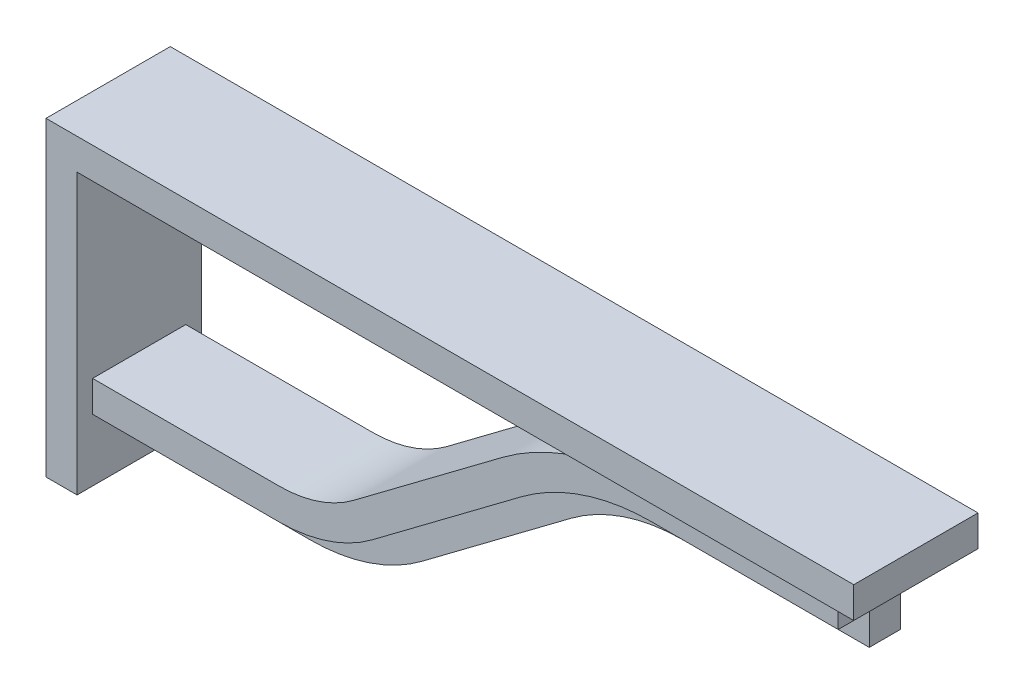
ISO-10303-21;
HEADER;
FILE_DESCRIPTION(('STEP AP214'),'2;1');
FILE_NAME('part.step','',(''),(''),'','','');
FILE_SCHEMA(('AUTOMOTIVE_DESIGN { 1 0 10303 214 1 1 1 1 }'));
ENDSEC;
DATA;
#1=APPLICATION_CONTEXT('core data for automotive mechanical design processes');
#2=APPLICATION_PROTOCOL_DEFINITION('international standard','automotive_design',2000,#1);
#3=PRODUCT_CONTEXT('',#1,'mechanical');
#4=PRODUCT('Part','Part','',(#3));
#5=PRODUCT_RELATED_PRODUCT_CATEGORY('part','',(#4));
#6=PRODUCT_DEFINITION_FORMATION('','',#4);
#7=PRODUCT_DEFINITION_CONTEXT('part definition',#1,'design');
#8=PRODUCT_DEFINITION('design','',#6,#7);
#9=PRODUCT_DEFINITION_SHAPE('','',#8);
#10=(LENGTH_UNIT() NAMED_UNIT(*) SI_UNIT(.MILLI.,.METRE.));
#11=(NAMED_UNIT(*) PLANE_ANGLE_UNIT() SI_UNIT($,.RADIAN.));
#12=(NAMED_UNIT(*) SI_UNIT($,.STERADIAN.) SOLID_ANGLE_UNIT());
#13=UNCERTAINTY_MEASURE_WITH_UNIT(LENGTH_MEASURE(1.E-05),#10,'distance_accuracy_value','');
#14=(GEOMETRIC_REPRESENTATION_CONTEXT(3) GLOBAL_UNCERTAINTY_ASSIGNED_CONTEXT((#13)) GLOBAL_UNIT_ASSIGNED_CONTEXT((#10,
#11,#12)) REPRESENTATION_CONTEXT('',''));
#15=CARTESIAN_POINT('',(0.,0.,0.));
#16=DIRECTION('',(0.,0.,1.));
#17=DIRECTION('',(1.,0.,0.));
#18=AXIS2_PLACEMENT_3D('',#15,#16,#17);
#19=CARTESIAN_POINT('',(0.,25.4,-19.05));
#20=CARTESIAN_POINT('',(-12.6999999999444,25.4,-19.05));
#21=CARTESIAN_POINT('',(-25.4000000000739,25.4,-19.05));
#22=CARTESIAN_POINT('',(-44.449999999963,25.4,-19.05));
#23=CARTESIAN_POINT('',(-50.8000000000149,25.4,-19.05));
#24=CARTESIAN_POINT('',(-60.3249999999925,25.4,-19.05));
#25=CARTESIAN_POINT('',(-63.4999999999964,25.4,-19.05));
#26=CARTESIAN_POINT('',(-68.2625000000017,25.4,-19.05));
#27=CARTESIAN_POINT('',(-69.8500000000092,25.4,-19.05));
#28=CARTESIAN_POINT('',(-72.2312499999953,25.4,-19.05));
#29=CARTESIAN_POINT('',(-73.0250000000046,25.4,-19.05));
#30=CARTESIAN_POINT('',(-74.2156249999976,25.4,-19.05));
#31=CARTESIAN_POINT('',(-74.6124999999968,25.4,-19.05));
#32=CARTESIAN_POINT('',(-75.2078125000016,25.4,-19.05));
#33=CARTESIAN_POINT('',(-75.4062500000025,25.4,-19.05));
#34=CARTESIAN_POINT('',(-75.7039062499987,25.4,-19.05));
#35=CARTESIAN_POINT('',(-75.8031249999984,25.4,-19.05));
#36=CARTESIAN_POINT('',(-76.0015625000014,25.4,-19.05));
#37=CARTESIAN_POINT('',(-76.0842447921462,25.4000004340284,-19.05));
#38=CARTESIAN_POINT('',(-76.348977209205,25.3999994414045,-19.05));
#39=CARTESIAN_POINT('',(-76.5405188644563,25.3995720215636,-19.05));
#40=CARTESIAN_POINT('',(-76.8810321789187,25.3978601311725,-19.05));
#41=CARTESIAN_POINT('',(-77.0512862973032,25.3965762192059,-19.05));
#42=CARTESIAN_POINT('',(-77.5620348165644,25.3914406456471,-19.05));
#43=CARTESIAN_POINT('',(-77.9025153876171,25.3863051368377,-19.05));
#44=CARTESIAN_POINT('',(-78.9238517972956,25.3657640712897,-19.05));
#45=CARTESIAN_POINT('',(-79.6046024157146,25.3452238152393,-19.05));
#46=CARTESIAN_POINT('',(-81.646030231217,25.2630767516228,-19.05));
#47=CARTESIAN_POINT('',(-83.005884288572,25.1809409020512,-19.05));
#48=CARTESIAN_POINT('',(-87.0788873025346,24.8526138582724,-19.05));
#49=CARTESIAN_POINT('',(-89.7854770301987,24.5244566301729,-19.05));
#50=CARTESIAN_POINT('',(-97.8525936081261,23.2153438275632,-19.05));
#51=CARTESIAN_POINT('',(-103.160020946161,21.9091297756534,-19.05));
#52=CARTESIAN_POINT('',(-113.497461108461,18.4633163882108,-19.05));
#53=CARTESIAN_POINT('',(-118.52713141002,16.3238312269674,-19.05));
#54=CARTESIAN_POINT('',(-125.766292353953,12.530851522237,-19.05));
#55=CARTESIAN_POINT('',(-128.128458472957,11.1694234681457,-19.05));
#56=CARTESIAN_POINT('',(-131.583857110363,8.98828329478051,-19.05));
#57=CARTESIAN_POINT('',(-132.721021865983,8.23807954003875,-19.05));
#58=CARTESIAN_POINT('',(-134.403452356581,7.07894050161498,-19.05));
#59=CARTESIAN_POINT('',(-134.960377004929,6.68692233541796,-19.05));
#60=CARTESIAN_POINT('',(-135.789770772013,6.09055334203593,-19.05));
#61=CARTESIAN_POINT('',(-136.065236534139,5.89037340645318,-19.05));
#62=CARTESIAN_POINT('',(-136.47691669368,5.58803275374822,-19.05));
#63=CARTESIAN_POINT('',(-136.613890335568,5.4869074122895,-19.05));
#64=CARTESIAN_POINT('',(-136.887328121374,5.28396893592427,-19.05));
#65=CARTESIAN_POINT('',(-137.040817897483,5.16938587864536,-19.05));
#66=CARTESIAN_POINT('',(-137.252604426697,5.01054722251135,-19.05));
#67=CARTESIAN_POINT('',(-137.31875,4.96093749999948,-19.05));
#68=CARTESIAN_POINT('',(-137.4775,4.84187500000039,-19.05));
#69=CARTESIAN_POINT('',(-137.556875,4.78234375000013,-19.05));
#70=CARTESIAN_POINT('',(-137.795,4.6037499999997,-19.05));
#71=CARTESIAN_POINT('',(-137.953750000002,4.48468749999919,-19.05));
#72=CARTESIAN_POINT('',(-138.429999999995,4.12750000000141,-19.05));
#73=CARTESIAN_POINT('',(-138.747499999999,3.88937500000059,-19.05));
#74=CARTESIAN_POINT('',(-139.700000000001,3.17499999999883,-19.05));
#75=CARTESIAN_POINT('',(-140.334999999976,2.69875000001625,-19.05));
#76=CARTESIAN_POINT('',(-142.240000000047,1.2699999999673,-19.05));
#77=CARTESIAN_POINT('',(-143.510000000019,0.317499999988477,-19.05));
#78=CARTESIAN_POINT('',(-147.319999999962,-2.53999999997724,-19.05));
#79=CARTESIAN_POINT('',(-149.859999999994,-4.44499999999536,-19.05));
#80=CARTESIAN_POINT('',(-157.480000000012,-10.1600000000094,-19.05));
#81=CARTESIAN_POINT('',(-162.560000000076,-13.9700000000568,-19.05));
#82=CARTESIAN_POINT('',(-172.719999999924,-21.5899999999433,-19.05));
#83=CARTESIAN_POINT('',(-177.799999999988,-25.3999999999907,-19.05));
#84=CARTESIAN_POINT('',(-185.420000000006,-31.1150000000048,-19.05));
#85=CARTESIAN_POINT('',(-187.959999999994,-33.0199999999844,-19.05));
#86=CARTESIAN_POINT('',(-191.770000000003,-35.8775000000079,-19.05));
#87=CARTESIAN_POINT('',(-193.040000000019,-36.8300000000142,-19.05));
#88=CARTESIAN_POINT('',(-194.944999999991,-38.2587499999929,-19.05));
#89=CARTESIAN_POINT('',(-195.579999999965,-38.7349999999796,-19.05));
#90=CARTESIAN_POINT('',(-196.532500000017,-39.4493750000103,-19.05));
#91=CARTESIAN_POINT('',(-196.849999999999,-39.6875000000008,-19.05));
#92=CARTESIAN_POINT('',(-197.32625,-40.0446874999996,-19.05));
#93=CARTESIAN_POINT('',(-197.485,-40.1637499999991,-19.05));
#94=CARTESIAN_POINT('',(-197.723125,-40.3423437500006,-19.05));
#95=CARTESIAN_POINT('',(-197.802500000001,-40.4018750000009,-19.05));
#96=CARTESIAN_POINT('',(-197.961249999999,-40.5209374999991,-19.05));
#97=CARTESIAN_POINT('',(-198.053854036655,-40.5903907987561,-19.05));
#98=CARTESIAN_POINT('',(-198.20513000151,-40.7038471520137,-19.05));
#99=CARTESIAN_POINT('',(-198.25633593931,-40.7419844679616,-19.05));
#100=CARTESIAN_POINT('',(-198.393054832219,-40.8434537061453,-19.05));
#101=CARTESIAN_POINT('',(-198.461541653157,-40.8940163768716,-19.05));
#102=CARTESIAN_POINT('',(-198.667381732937,-41.0451867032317,-19.05));
#103=CARTESIAN_POINT('',(-198.805114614,-41.1452766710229,-19.05));
#104=CARTESIAN_POINT('',(-199.219811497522,-41.4434611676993,-19.05));
#105=CARTESIAN_POINT('',(-199.498273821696,-41.6394702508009,-19.05));
#106=CARTESIAN_POINT('',(-200.339489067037,-42.2190397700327,-19.05));
#107=CARTESIAN_POINT('',(-200.90807144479,-42.5941416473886,-19.05));
#108=CARTESIAN_POINT('',(-202.635770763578,-43.6847117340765,-19.05));
#109=CARTESIAN_POINT('',(-203.816853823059,-44.3654257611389,-19.05));
#110=CARTESIAN_POINT('',(-207.436434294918,-46.2619156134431,-19.05));
#111=CARTESIAN_POINT('',(-209.951269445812,-47.3316581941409,-19.05));
#112=CARTESIAN_POINT('',(-215.119989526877,-49.0545648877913,-19.05));
#113=CARTESIAN_POINT('',(-217.773703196,-49.7076719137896,-19.05));
#114=CARTESIAN_POINT('',(-221.807261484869,-50.3622283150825,-19.05));
#115=CARTESIAN_POINT('',(-223.160556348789,-50.526306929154,-19.05));
#116=CARTESIAN_POINT('',(-225.197057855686,-50.6904704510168,-19.05));
#117=CARTESIAN_POINT('',(-225.876984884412,-50.7315383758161,-19.05));
#118=CARTESIAN_POINT('',(-226.897698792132,-50.7726119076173,-19.05));
#119=CARTESIAN_POINT('',(-227.238074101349,-50.782882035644,-19.05));
#120=CARTESIAN_POINT('',(-227.748742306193,-50.7931525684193,-19.05));
#121=CARTESIAN_POINT('',(-227.91898259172,-50.7957203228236,-19.05));
#122=CARTESIAN_POINT('',(-228.174356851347,-50.798288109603,-19.05));
#123=CARTESIAN_POINT('',(-228.259483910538,-50.7989300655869,-19.05));
#124=CARTESIAN_POINT('',(-228.429740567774,-50.7997860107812,-19.05));
#125=CARTESIAN_POINT('',(-228.493587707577,-50.7999997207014,-19.05));
#126=CARTESIAN_POINT('',(-228.682682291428,-50.8000002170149,-19.05));
#127=CARTESIAN_POINT('',(-228.798437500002,-50.8,-19.05));
#128=CARTESIAN_POINT('',(-228.996874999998,-50.8,-19.05));
#129=CARTESIAN_POINT('',(-229.096093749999,-50.8,-19.05));
#130=CARTESIAN_POINT('',(-229.393750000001,-50.8,-19.05));
#131=CARTESIAN_POINT('',(-229.592187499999,-50.8,-19.05));
#132=CARTESIAN_POINT('',(-230.187500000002,-50.8,-19.05));
#133=CARTESIAN_POINT('',(-230.584374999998,-50.8,-19.05));
#134=CARTESIAN_POINT('',(-231.775000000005,-50.8,-19.05));
#135=CARTESIAN_POINT('',(-232.568750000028,-50.8,-19.05));
#136=CARTESIAN_POINT('',(-234.949999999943,-50.8,-19.05));
#137=CARTESIAN_POINT('',(-236.537500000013,-50.8,-19.05));
#138=CARTESIAN_POINT('',(-241.299999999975,-50.8,-19.05));
#139=CARTESIAN_POINT('',(-244.474999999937,-50.8,-19.05));
#140=CARTESIAN_POINT('',(-254.000000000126,-50.8,-19.05));
#141=CARTESIAN_POINT('',(-260.349999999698,-50.799999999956,-19.05));
#142=CARTESIAN_POINT('',(-279.400000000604,-50.8000000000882,-19.05));
#143=CARTESIAN_POINT('',(-292.099999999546,-50.8000000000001,-19.05));
#144=CARTESIAN_POINT('',(-304.8,-50.8000000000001,-19.05));
#145=CARTESIAN_POINT('',(0.,25.4,19.05));
#146=CARTESIAN_POINT('',(-12.6999999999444,25.4,19.05));
#147=CARTESIAN_POINT('',(-25.4000000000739,25.4,19.05));
#148=CARTESIAN_POINT('',(-44.449999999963,25.4,19.05));
#149=CARTESIAN_POINT('',(-50.8000000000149,25.4,19.05));
#150=CARTESIAN_POINT('',(-60.3249999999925,25.4,19.05));
#151=CARTESIAN_POINT('',(-63.4999999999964,25.4,19.05));
#152=CARTESIAN_POINT('',(-68.2625000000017,25.4,19.05));
#153=CARTESIAN_POINT('',(-69.8500000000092,25.4,19.05));
#154=CARTESIAN_POINT('',(-72.2312499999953,25.4,19.05));
#155=CARTESIAN_POINT('',(-73.0250000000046,25.4,19.05));
#156=CARTESIAN_POINT('',(-74.2156249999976,25.4,19.05));
#157=CARTESIAN_POINT('',(-74.6124999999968,25.4,19.05));
#158=CARTESIAN_POINT('',(-75.2078125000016,25.4,19.05));
#159=CARTESIAN_POINT('',(-75.4062500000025,25.4,19.05));
#160=CARTESIAN_POINT('',(-75.7039062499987,25.4,19.05));
#161=CARTESIAN_POINT('',(-75.8031249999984,25.4,19.05));
#162=CARTESIAN_POINT('',(-76.0015625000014,25.4,19.05));
#163=CARTESIAN_POINT('',(-76.0842447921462,25.4000004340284,19.05));
#164=CARTESIAN_POINT('',(-76.348977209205,25.3999994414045,19.05));
#165=CARTESIAN_POINT('',(-76.5405188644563,25.3995720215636,19.05));
#166=CARTESIAN_POINT('',(-76.8810321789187,25.3978601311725,19.05));
#167=CARTESIAN_POINT('',(-77.0512862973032,25.3965762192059,19.05));
#168=CARTESIAN_POINT('',(-77.5620348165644,25.3914406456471,19.05));
#169=CARTESIAN_POINT('',(-77.9025153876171,25.3863051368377,19.05));
#170=CARTESIAN_POINT('',(-78.9238517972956,25.3657640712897,19.05));
#171=CARTESIAN_POINT('',(-79.6046024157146,25.3452238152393,19.05));
#172=CARTESIAN_POINT('',(-81.646030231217,25.2630767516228,19.05));
#173=CARTESIAN_POINT('',(-83.005884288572,25.1809409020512,19.05));
#174=CARTESIAN_POINT('',(-87.0788873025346,24.8526138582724,19.05));
#175=CARTESIAN_POINT('',(-89.7854770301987,24.5244566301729,19.05));
#176=CARTESIAN_POINT('',(-97.8525936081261,23.2153438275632,19.05));
#177=CARTESIAN_POINT('',(-103.160020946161,21.9091297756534,19.05));
#178=CARTESIAN_POINT('',(-113.497461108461,18.4633163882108,19.05));
#179=CARTESIAN_POINT('',(-118.52713141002,16.3238312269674,19.05));
#180=CARTESIAN_POINT('',(-125.766292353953,12.530851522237,19.05));
#181=CARTESIAN_POINT('',(-128.128458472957,11.1694234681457,19.05));
#182=CARTESIAN_POINT('',(-131.583857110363,8.98828329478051,19.05));
#183=CARTESIAN_POINT('',(-132.721021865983,8.23807954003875,19.05));
#184=CARTESIAN_POINT('',(-134.403452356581,7.07894050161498,19.05));
#185=CARTESIAN_POINT('',(-134.960377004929,6.68692233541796,19.05));
#186=CARTESIAN_POINT('',(-135.789770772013,6.09055334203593,19.05));
#187=CARTESIAN_POINT('',(-136.065236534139,5.89037340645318,19.05));
#188=CARTESIAN_POINT('',(-136.47691669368,5.58803275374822,19.05));
#189=CARTESIAN_POINT('',(-136.613890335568,5.4869074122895,19.05));
#190=CARTESIAN_POINT('',(-136.887328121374,5.28396893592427,19.05));
#191=CARTESIAN_POINT('',(-137.040817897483,5.16938587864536,19.05));
#192=CARTESIAN_POINT('',(-137.252604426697,5.01054722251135,19.05));
#193=CARTESIAN_POINT('',(-137.31875,4.96093749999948,19.05));
#194=CARTESIAN_POINT('',(-137.4775,4.84187500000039,19.05));
#195=CARTESIAN_POINT('',(-137.556875,4.78234375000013,19.05));
#196=CARTESIAN_POINT('',(-137.795,4.6037499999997,19.05));
#197=CARTESIAN_POINT('',(-137.953750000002,4.48468749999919,19.05));
#198=CARTESIAN_POINT('',(-138.429999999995,4.12750000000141,19.05));
#199=CARTESIAN_POINT('',(-138.747499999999,3.88937500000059,19.05));
#200=CARTESIAN_POINT('',(-139.700000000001,3.17499999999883,19.05));
#201=CARTESIAN_POINT('',(-140.334999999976,2.69875000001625,19.05));
#202=CARTESIAN_POINT('',(-142.240000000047,1.2699999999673,19.05));
#203=CARTESIAN_POINT('',(-143.510000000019,0.317499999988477,19.05));
#204=CARTESIAN_POINT('',(-147.319999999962,-2.53999999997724,19.05));
#205=CARTESIAN_POINT('',(-149.859999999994,-4.44499999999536,19.05));
#206=CARTESIAN_POINT('',(-157.480000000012,-10.1600000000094,19.05));
#207=CARTESIAN_POINT('',(-162.560000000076,-13.9700000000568,19.05));
#208=CARTESIAN_POINT('',(-172.719999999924,-21.5899999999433,19.05));
#209=CARTESIAN_POINT('',(-177.799999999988,-25.3999999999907,19.05));
#210=CARTESIAN_POINT('',(-185.420000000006,-31.1150000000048,19.05));
#211=CARTESIAN_POINT('',(-187.959999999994,-33.0199999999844,19.05));
#212=CARTESIAN_POINT('',(-191.770000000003,-35.8775000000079,19.05));
#213=CARTESIAN_POINT('',(-193.040000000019,-36.8300000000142,19.05));
#214=CARTESIAN_POINT('',(-194.944999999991,-38.2587499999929,19.05));
#215=CARTESIAN_POINT('',(-195.579999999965,-38.7349999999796,19.05));
#216=CARTESIAN_POINT('',(-196.532500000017,-39.4493750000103,19.05));
#217=CARTESIAN_POINT('',(-196.849999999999,-39.6875000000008,19.05));
#218=CARTESIAN_POINT('',(-197.32625,-40.0446874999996,19.05));
#219=CARTESIAN_POINT('',(-197.485,-40.1637499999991,19.05));
#220=CARTESIAN_POINT('',(-197.723125,-40.3423437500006,19.05));
#221=CARTESIAN_POINT('',(-197.802500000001,-40.4018750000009,19.05));
#222=CARTESIAN_POINT('',(-197.961249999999,-40.5209374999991,19.05));
#223=CARTESIAN_POINT('',(-198.053854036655,-40.5903907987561,19.05));
#224=CARTESIAN_POINT('',(-198.20513000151,-40.7038471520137,19.05));
#225=CARTESIAN_POINT('',(-198.25633593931,-40.7419844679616,19.05));
#226=CARTESIAN_POINT('',(-198.393054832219,-40.8434537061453,19.05));
#227=CARTESIAN_POINT('',(-198.461541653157,-40.8940163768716,19.05));
#228=CARTESIAN_POINT('',(-198.667381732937,-41.0451867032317,19.05));
#229=CARTESIAN_POINT('',(-198.805114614,-41.1452766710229,19.05));
#230=CARTESIAN_POINT('',(-199.219811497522,-41.4434611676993,19.05));
#231=CARTESIAN_POINT('',(-199.498273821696,-41.6394702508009,19.05));
#232=CARTESIAN_POINT('',(-200.339489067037,-42.2190397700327,19.05));
#233=CARTESIAN_POINT('',(-200.90807144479,-42.5941416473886,19.05));
#234=CARTESIAN_POINT('',(-202.635770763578,-43.6847117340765,19.05));
#235=CARTESIAN_POINT('',(-203.816853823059,-44.3654257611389,19.05));
#236=CARTESIAN_POINT('',(-207.436434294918,-46.2619156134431,19.05));
#237=CARTESIAN_POINT('',(-209.951269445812,-47.3316581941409,19.05));
#238=CARTESIAN_POINT('',(-215.119989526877,-49.0545648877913,19.05));
#239=CARTESIAN_POINT('',(-217.773703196,-49.7076719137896,19.05));
#240=CARTESIAN_POINT('',(-221.807261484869,-50.3622283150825,19.05));
#241=CARTESIAN_POINT('',(-223.160556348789,-50.526306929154,19.05));
#242=CARTESIAN_POINT('',(-225.197057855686,-50.6904704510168,19.05));
#243=CARTESIAN_POINT('',(-225.876984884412,-50.7315383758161,19.05));
#244=CARTESIAN_POINT('',(-226.897698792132,-50.7726119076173,19.05));
#245=CARTESIAN_POINT('',(-227.238074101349,-50.782882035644,19.05));
#246=CARTESIAN_POINT('',(-227.748742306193,-50.7931525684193,19.05));
#247=CARTESIAN_POINT('',(-227.91898259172,-50.7957203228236,19.05));
#248=CARTESIAN_POINT('',(-228.174356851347,-50.798288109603,19.05));
#249=CARTESIAN_POINT('',(-228.259483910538,-50.7989300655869,19.05));
#250=CARTESIAN_POINT('',(-228.429740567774,-50.7997860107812,19.05));
#251=CARTESIAN_POINT('',(-228.493587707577,-50.7999997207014,19.05));
#252=CARTESIAN_POINT('',(-228.682682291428,-50.8000002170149,19.05));
#253=CARTESIAN_POINT('',(-228.798437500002,-50.8,19.05));
#254=CARTESIAN_POINT('',(-228.996874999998,-50.8,19.05));
#255=CARTESIAN_POINT('',(-229.096093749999,-50.8,19.05));
#256=CARTESIAN_POINT('',(-229.393750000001,-50.8,19.05));
#257=CARTESIAN_POINT('',(-229.592187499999,-50.8,19.05));
#258=CARTESIAN_POINT('',(-230.187500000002,-50.8,19.05));
#259=CARTESIAN_POINT('',(-230.584374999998,-50.8,19.05));
#260=CARTESIAN_POINT('',(-231.775000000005,-50.8,19.05));
#261=CARTESIAN_POINT('',(-232.568750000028,-50.8,19.05));
#262=CARTESIAN_POINT('',(-234.949999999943,-50.8,19.05));
#263=CARTESIAN_POINT('',(-236.537500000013,-50.8,19.05));
#264=CARTESIAN_POINT('',(-241.299999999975,-50.8,19.05));
#265=CARTESIAN_POINT('',(-244.474999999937,-50.8,19.05));
#266=CARTESIAN_POINT('',(-254.000000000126,-50.8,19.05));
#267=CARTESIAN_POINT('',(-260.349999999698,-50.799999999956,19.05));
#268=CARTESIAN_POINT('',(-279.400000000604,-50.8000000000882,19.05));
#269=CARTESIAN_POINT('',(-292.099999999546,-50.8000000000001,19.05));
#270=CARTESIAN_POINT('',(-304.8,-50.8000000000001,19.05));
#271=B_SPLINE_SURFACE_WITH_KNOTS('',1,3,((#19,#20,#21,#22,#23,#24,#25,#26,#27,#28,#29,#30,#31,
#32,#33,#34,#35,#36,#37,#38,#39,#40,#41,#42,#43,#44,#45,#46,#47,#48,#49,#50,#51,#52,#53,#54,#55,
#56,#57,#58,#59,#60,#61,#62,#63,#64,#65,#66,#67,#68,#69,#70,#71,#72,#73,#74,#75,#76,#77,#78,#79,
#80,#81,#82,#83,#84,#85,#86,#87,#88,#89,#90,#91,#92,#93,#94,#95,#96,#97,#98,#99,#100,#101,#102,
#103,#104,#105,#106,#107,#108,#109,#110,#111,#112,#113,#114,#115,#116,#117,#118,#119,#120,#121,
#122,#123,#124,#125,#126,#127,#128,#129,#130,#131,#132,#133,#134,#135,#136,#137,#138,#139,#140,
#141,#142,#143,#144),(#145,#146,#147,#148,#149,#150,#151,#152,#153,#154,#155,#156,#157,#158,
#159,#160,#161,#162,#163,#164,#165,#166,#167,#168,#169,#170,#171,#172,#173,#174,#175,#176,#177,
#178,#179,#180,#181,#182,#183,#184,#185,#186,#187,#188,#189,#190,#191,#192,#193,#194,#195,#196,
#197,#198,#199,#200,#201,#202,#203,#204,#205,#206,#207,#208,#209,#210,#211,#212,#213,#214,#215,
#216,#217,#218,#219,#220,#221,#222,#223,#224,#225,#226,#227,#228,#229,#230,#231,#232,#233,#234,
#235,#236,#237,#238,#239,#240,#241,#242,#243,#244,#245,#246,#247,#248,#249,#250,#251,#252,#253,
#254,#255,#256,#257,#258,#259,#260,#261,#262,#263,#264,#265,#266,#267,#268,#269,#270)),
.UNSPECIFIED.,.F.,.F.,.F.,(2,2),(4,2,2,2,2,2,2,2,2,2,2,2,2,2,2,2,2,2,2,2,2,2,2,2,2,2,2,2,2,2,2,
2,2,2,2,2,2,2,2,2,2,2,2,2,2,2,2,2,2,2,2,2,2,2,2,2,2,2,2,2,2,2,4),(0.,1.),(0.,0.116631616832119,
0.174947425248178,0.204105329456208,0.218684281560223,0.22597375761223,0.229618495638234,
0.231440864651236,0.232352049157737,0.233263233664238,0.234435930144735,0.235608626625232,
0.237954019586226,0.242644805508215,0.252026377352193,0.270789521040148,0.308315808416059,
0.34584209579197,0.364605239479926,0.373986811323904,0.378677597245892,0.381022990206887,
0.382195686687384,0.383368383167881,0.384279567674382,0.385190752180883,0.387013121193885,
0.390657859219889,0.397947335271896,0.412526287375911,0.441684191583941,0.5,0.558315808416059,
0.587473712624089,0.602052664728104,0.609342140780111,0.612986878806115,0.614809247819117,
0.615720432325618,0.616631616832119,0.617804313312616,0.618977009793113,0.621322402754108,
0.626013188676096,0.635394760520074,0.65415790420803,0.691684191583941,0.729210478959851,
0.747973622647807,0.757355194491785,0.762045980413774,0.764391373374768,0.765564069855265,
0.766736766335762,0.767647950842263,0.768559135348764,0.770381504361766,0.77402624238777,
0.781315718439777,0.795894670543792,0.825052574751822,0.883368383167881,1.),.UNSPECIFIED.);
#272=DIRECTION('',(0.,0.,1.));
#273=VECTOR('',#272,1.);
#274=CARTESIAN_POINT('',(-76.2,25.4,0.));
#275=LINE('',#274,#273);
#276=CARTESIAN_POINT('',(-76.2,25.4,-19.05));
#277=VERTEX_POINT('',#276);
#278=CARTESIAN_POINT('',(-76.2,25.4,19.05));
#279=VERTEX_POINT('',#278);
#280=EDGE_CURVE('E604',#277,#279,#275,.T.);
#281=CARTESIAN_POINT('',(-76.2,-76.2,-19.05));
#282=DIRECTION('',(0.,0.,1.));
#283=DIRECTION('',(0.,1.,0.));
#284=AXIS2_PLACEMENT_3D('',#281,#282,#283);
#285=CIRCLE('',#284,101.6);
#286=CARTESIAN_POINT('',(-137.16,5.07999999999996,-19.05));
#287=VERTEX_POINT('',#286);
#288=EDGE_CURVE('E38',#277,#287,#285,.T.);
#289=DIRECTION('',(-0.8,-0.6,0.));
#290=VECTOR('',#289,1.);
#291=CARTESIAN_POINT('',(-137.16,5.07999999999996,-19.05));
#292=LINE('',#291,#290);
#293=CARTESIAN_POINT('',(-198.12,-40.64,-19.05));
#294=VERTEX_POINT('',#293);
#295=EDGE_CURVE('E265',#287,#294,#292,.T.);
#296=CARTESIAN_POINT('',(-228.6,0.,-19.05));
#297=DIRECTION('',(0.,0.,-1.));
#298=DIRECTION('',(0.6,-0.8,0.));
#299=AXIS2_PLACEMENT_3D('',#296,#297,#298);
#300=CIRCLE('',#299,50.8);
#301=CARTESIAN_POINT('',(-228.6,-50.8,-19.05));
#302=VERTEX_POINT('',#301);
#303=EDGE_CURVE('E257',#294,#302,#300,.T.);
#304=DIRECTION('',(-1.,0.,0.));
#305=VECTOR('',#304,1.);
#306=CARTESIAN_POINT('',(-228.6,-50.8,-19.05));
#307=LINE('',#306,#305);
#308=CARTESIAN_POINT('',(-304.8,-50.8000000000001,-19.05));
#309=VERTEX_POINT('',#308);
#310=EDGE_CURVE('E461',#302,#309,#307,.T.);
#311=DIRECTION('',(0.,0.,1.));
#312=VECTOR('',#311,1.);
#313=CARTESIAN_POINT('',(-304.8,-50.8000000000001,-19.05));
#314=LINE('',#313,#312);
#315=CARTESIAN_POINT('',(-304.8,-50.8000000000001,19.05));
#316=VERTEX_POINT('',#315);
#317=EDGE_CURVE('E458',#309,#316,#314,.T.);
#318=DIRECTION('',(-1.,0.,0.));
#319=VECTOR('',#318,1.);
#320=CARTESIAN_POINT('',(-228.6,-50.8,19.05));
#321=LINE('',#320,#319);
#322=CARTESIAN_POINT('',(-228.6,-50.8,19.05));
#323=VERTEX_POINT('',#322);
#324=EDGE_CURVE('E455',#323,#316,#321,.T.);
#325=CARTESIAN_POINT('',(-228.6,0.,19.05));
#326=DIRECTION('',(0.,0.,-1.));
#327=DIRECTION('',(0.6,-0.8,0.));
#328=AXIS2_PLACEMENT_3D('',#325,#326,#327);
#329=CIRCLE('',#328,50.8);
#330=CARTESIAN_POINT('',(-198.12,-40.64,19.05));
#331=VERTEX_POINT('',#330);
#332=EDGE_CURVE('E261',#331,#323,#329,.T.);
#333=DIRECTION('',(-0.8,-0.6,0.));
#334=VECTOR('',#333,1.);
#335=CARTESIAN_POINT('',(-137.16,5.07999999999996,19.05));
#336=LINE('',#335,#334);
#337=CARTESIAN_POINT('',(-137.16,5.07999999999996,19.05));
#338=VERTEX_POINT('',#337);
#339=EDGE_CURVE('E268',#338,#331,#336,.T.);
#340=CARTESIAN_POINT('',(-76.2,-76.2,19.05));
#341=DIRECTION('',(0.,0.,1.));
#342=DIRECTION('',(0.,1.,0.));
#343=AXIS2_PLACEMENT_3D('',#340,#341,#342);
#344=CIRCLE('',#343,101.6);
#345=EDGE_CURVE('E197',#279,#338,#344,.T.);
#346=ORIENTED_EDGE('',*,*,#280,.F.);
#347=ORIENTED_EDGE('',*,*,#288,.T.);
#348=ORIENTED_EDGE('',*,*,#295,.T.);
#349=ORIENTED_EDGE('',*,*,#303,.T.);
#350=ORIENTED_EDGE('',*,*,#310,.T.);
#351=ORIENTED_EDGE('',*,*,#317,.T.);
#352=ORIENTED_EDGE('',*,*,#324,.F.);
#353=ORIENTED_EDGE('',*,*,#332,.F.);
#354=ORIENTED_EDGE('',*,*,#339,.F.);
#355=ORIENTED_EDGE('',*,*,#345,.F.);
#356=EDGE_LOOP('',(#346,#347,#348,#349,#350,#351,#352,#353,#354,#355));
#357=FACE_BOUND('',#356,.T.);
#358=ADVANCED_FACE('F34',(#357),#271,.F.);
#359=CARTESIAN_POINT('',(0.,0.,0.));
#360=DIRECTION('',(1.,0.,0.));
#361=DIRECTION('',(0.,0.,-1.));
#362=AXIS2_PLACEMENT_3D('',#359,#360,#361);
#363=PLANE('',#362);
#364=DIRECTION('',(0.,-1.,0.));
#365=VECTOR('',#364,1.);
#366=CARTESIAN_POINT('',(0.,12.7,6.35));
#367=LINE('',#366,#365);
#368=CARTESIAN_POINT('',(0.,12.7,6.35));
#369=VERTEX_POINT('',#368);
#370=CARTESIAN_POINT('',(0.,0.,6.35));
#371=VERTEX_POINT('',#370);
#372=EDGE_CURVE('E184',#369,#371,#367,.T.);
#373=ORIENTED_EDGE('',*,*,#372,.T.);
#374=DIRECTION('',(0.,0.,-1.));
#375=VECTOR('',#374,1.);
#376=CARTESIAN_POINT('',(0.,0.,6.35));
#377=LINE('',#376,#375);
#378=CARTESIAN_POINT('',(0.,0.,-6.35));
#379=VERTEX_POINT('',#378);
#380=EDGE_CURVE('E573',#371,#379,#377,.T.);
#381=ORIENTED_EDGE('',*,*,#380,.T.);
#382=DIRECTION('',(0.,1.,0.));
#383=VECTOR('',#382,1.);
#384=CARTESIAN_POINT('',(0.,0.,-6.35));
#385=LINE('',#384,#383);
#386=CARTESIAN_POINT('',(0.,12.7,-6.35));
#387=VERTEX_POINT('',#386);
#388=EDGE_CURVE('E568',#379,#387,#385,.T.);
#389=ORIENTED_EDGE('',*,*,#388,.T.);
#390=DIRECTION('',(0.,0.,-1.));
#391=VECTOR('',#390,1.);
#392=CARTESIAN_POINT('',(0.,12.7,-6.35));
#393=LINE('',#392,#391);
#394=CARTESIAN_POINT('',(0.,12.7,-19.05));
#395=VERTEX_POINT('',#394);
#396=EDGE_CURVE('E538',#387,#395,#393,.T.);
#397=ORIENTED_EDGE('',*,*,#396,.T.);
#398=DIRECTION('',(0.,1.,0.));
#399=VECTOR('',#398,1.);
#400=CARTESIAN_POINT('',(0.,12.7,-19.05));
#401=LINE('',#400,#399);
#402=CARTESIAN_POINT('',(0.,25.4,-19.05));
#403=VERTEX_POINT('',#402);
#404=EDGE_CURVE('E533',#395,#403,#401,.T.);
#405=ORIENTED_EDGE('',*,*,#404,.T.);
#406=DIRECTION('',(0.,0.,1.));
#407=VECTOR('',#406,1.);
#408=CARTESIAN_POINT('',(0.,25.4,-19.05));
#409=LINE('',#408,#407);
#410=CARTESIAN_POINT('',(0.,25.4,19.05));
#411=VERTEX_POINT('',#410);
#412=EDGE_CURVE('E530',#403,#411,#409,.T.);
#413=ORIENTED_EDGE('',*,*,#412,.T.);
#414=DIRECTION('',(0.,-1.,0.));
#415=VECTOR('',#414,1.);
#416=CARTESIAN_POINT('',(0.,25.4,19.05));
#417=LINE('',#416,#415);
#418=CARTESIAN_POINT('',(0.,12.7,19.05));
#419=VERTEX_POINT('',#418);
#420=EDGE_CURVE('E191',#411,#419,#417,.T.);
#421=ORIENTED_EDGE('',*,*,#420,.T.);
#422=DIRECTION('',(0.,0.,-1.));
#423=VECTOR('',#422,1.);
#424=CARTESIAN_POINT('',(0.,12.7,19.05));
#425=LINE('',#424,#423);
#426=EDGE_CURVE('E187',#419,#369,#425,.T.);
#427=ORIENTED_EDGE('',*,*,#426,.T.);
#428=EDGE_LOOP('',(#373,#381,#389,#397,#405,#413,#421,#427));
#429=FACE_BOUND('',#428,.T.);
#430=ADVANCED_FACE('F36',(#429),#363,.T.);
#431=CARTESIAN_POINT('',(0.,12.7,6.35));
#432=DIRECTION('',(0.,0.,-1.));
#433=DIRECTION('',(0.,1.,0.));
#434=AXIS2_PLACEMENT_3D('',#431,#432,#433);
#435=PLANE('',#434);
#436=DIRECTION('',(-1.,0.,0.));
#437=VECTOR('',#436,1.);
#438=CARTESIAN_POINT('',(-228.6,-76.2,6.35));
#439=LINE('',#438,#437);
#440=CARTESIAN_POINT('',(-228.6,-76.2,6.35));
#441=VERTEX_POINT('',#440);
#442=CARTESIAN_POINT('',(-304.8,-76.2,6.35));
#443=VERTEX_POINT('',#442);
#444=EDGE_CURVE('E484',#441,#443,#439,.T.);
#445=ORIENTED_EDGE('',*,*,#444,.F.);
#446=CARTESIAN_POINT('',(-228.6,0.,6.35));
#447=DIRECTION('',(0.,0.,-1.));
#448=DIRECTION('',(0.6,-0.8,0.));
#449=AXIS2_PLACEMENT_3D('',#446,#447,#448);
#450=CIRCLE('',#449,76.2);
#451=CARTESIAN_POINT('',(-182.88,-60.96,6.35));
#452=VERTEX_POINT('',#451);
#453=EDGE_CURVE('E389',#452,#441,#450,.T.);
#454=ORIENTED_EDGE('',*,*,#453,.F.);
#455=DIRECTION('',(-0.8,-0.6,0.));
#456=VECTOR('',#455,1.);
#457=CARTESIAN_POINT('',(-121.92,-15.24,6.35));
#458=LINE('',#457,#456);
#459=CARTESIAN_POINT('',(-121.92,-15.24,6.35));
#460=VERTEX_POINT('',#459);
#461=EDGE_CURVE('E397',#460,#452,#458,.T.);
#462=ORIENTED_EDGE('',*,*,#461,.F.);
#463=CARTESIAN_POINT('',(-76.2,-76.2,6.35));
#464=DIRECTION('',(0.,0.,1.));
#465=DIRECTION('',(0.,1.,0.));
#466=AXIS2_PLACEMENT_3D('',#463,#464,#465);
#467=CIRCLE('',#466,76.2);
#468=CARTESIAN_POINT('',(-76.1999999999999,0.,6.35));
#469=VERTEX_POINT('',#468);
#470=EDGE_CURVE('E161',#469,#460,#467,.T.);
#471=ORIENTED_EDGE('',*,*,#470,.F.);
#472=DIRECTION('',(-1.,0.,0.));
#473=VECTOR('',#472,1.);
#474=CARTESIAN_POINT('',(0.,0.,6.35));
#475=LINE('',#474,#473);
#476=EDGE_CURVE('E186',#371,#469,#475,.T.);
#477=ORIENTED_EDGE('',*,*,#476,.F.);
#478=ORIENTED_EDGE('',*,*,#372,.F.);
#479=DIRECTION('',(-1.,0.,0.));
#480=VECTOR('',#479,1.);
#481=CARTESIAN_POINT('',(0.,12.7,6.35));
#482=LINE('',#481,#480);
#483=CARTESIAN_POINT('',(-76.1999999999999,12.7,6.35));
#484=VERTEX_POINT('',#483);
#485=EDGE_CURVE('E173',#369,#484,#482,.T.);
#486=ORIENTED_EDGE('',*,*,#485,.T.);
#487=CARTESIAN_POINT('',(-76.2,-76.2,6.35));
#488=DIRECTION('',(0.,0.,1.));
#489=DIRECTION('',(0.,1.,0.));
#490=AXIS2_PLACEMENT_3D('',#487,#488,#489);
#491=CIRCLE('',#490,88.9);
#492=CARTESIAN_POINT('',(-129.54,-5.08000000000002,6.35));
#493=VERTEX_POINT('',#492);
#494=EDGE_CURVE('E168',#484,#493,#491,.T.);
#495=ORIENTED_EDGE('',*,*,#494,.T.);
#496=DIRECTION('',(-0.8,-0.6,0.));
#497=VECTOR('',#496,1.);
#498=CARTESIAN_POINT('',(-129.54,-5.08000000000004,6.35));
#499=LINE('',#498,#497);
#500=CARTESIAN_POINT('',(-190.5,-50.8,6.35));
#501=VERTEX_POINT('',#500);
#502=EDGE_CURVE('E175',#493,#501,#499,.T.);
#503=ORIENTED_EDGE('',*,*,#502,.T.);
#504=CARTESIAN_POINT('',(-228.6,0.,6.35));
#505=DIRECTION('',(0.,0.,-1.));
#506=DIRECTION('',(0.6,-0.8,0.));
#507=AXIS2_PLACEMENT_3D('',#504,#505,#506);
#508=CIRCLE('',#507,63.5);
#509=CARTESIAN_POINT('',(-228.6,-63.5,6.35));
#510=VERTEX_POINT('',#509);
#511=EDGE_CURVE('E394',#501,#510,#508,.T.);
#512=ORIENTED_EDGE('',*,*,#511,.T.);
#513=DIRECTION('',(-1.,0.,0.));
#514=VECTOR('',#513,1.);
#515=CARTESIAN_POINT('',(-228.6,-63.5,6.35));
#516=LINE('',#515,#514);
#517=CARTESIAN_POINT('',(-304.8,-63.5000000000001,6.35));
#518=VERTEX_POINT('',#517);
#519=EDGE_CURVE('E489',#510,#518,#516,.T.);
#520=ORIENTED_EDGE('',*,*,#519,.T.);
#521=DIRECTION('',(0.,-1.,0.));
#522=VECTOR('',#521,1.);
#523=CARTESIAN_POINT('',(-304.8,-63.5000000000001,6.35));
#524=LINE('',#523,#522);
#525=EDGE_CURVE('E54',#518,#443,#524,.T.);
#526=ORIENTED_EDGE('',*,*,#525,.T.);
#527=EDGE_LOOP('',(#445,#454,#462,#471,#477,#478,#486,#495,#503,#512,#520,#526));
#528=FACE_BOUND('',#527,.T.);
#529=ADVANCED_FACE('F182',(#528),#435,.F.);
#530=CARTESIAN_POINT('',(0.,0.,6.35));
#531=CARTESIAN_POINT('',(-12.6999999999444,0.,6.35));
#532=CARTESIAN_POINT('',(-25.4000000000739,0.,6.35));
#533=CARTESIAN_POINT('',(-44.449999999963,0.,6.35));
#534=CARTESIAN_POINT('',(-50.8000000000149,0.,6.35));
#535=CARTESIAN_POINT('',(-60.3249999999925,0.,6.35));
#536=CARTESIAN_POINT('',(-63.4999999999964,0.,6.35));
#537=CARTESIAN_POINT('',(-68.2625000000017,0.,6.35));
#538=CARTESIAN_POINT('',(-69.8500000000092,0.,6.35));
#539=CARTESIAN_POINT('',(-72.2312499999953,0.,6.35));
#540=CARTESIAN_POINT('',(-73.0250000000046,0.,6.35));
#541=CARTESIAN_POINT('',(-74.2156249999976,0.,6.35));
#542=CARTESIAN_POINT('',(-74.6124999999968,0.,6.35));
#543=CARTESIAN_POINT('',(-75.2078125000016,0.,6.35));
#544=CARTESIAN_POINT('',(-75.4062500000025,0.,6.35));
#545=CARTESIAN_POINT('',(-75.7039062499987,0.,6.35));
#546=CARTESIAN_POINT('',(-75.8031249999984,0.,6.35));
#547=CARTESIAN_POINT('',(-76.0015625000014,0.,6.35));
#548=CARTESIAN_POINT('',(-76.1007812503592,3.25521619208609E-07,6.35));
#549=CARTESIAN_POINT('',(-76.3276947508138,-4.1894704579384E-07,6.35));
#550=CARTESIAN_POINT('',(-76.455389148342,-0.000320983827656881,6.35));
#551=CARTESIAN_POINT('',(-76.7107741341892,-0.0016049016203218,6.35));
#552=CARTESIAN_POINT('',(-76.8384647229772,-0.00256783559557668,6.35));
#553=CARTESIAN_POINT('',(-77.2215261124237,-0.00641951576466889,6.35));
#554=CARTESIAN_POINT('',(-77.4768865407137,-0.0102711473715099,6.35));
#555=CARTESIAN_POINT('',(-78.2428888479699,-0.025676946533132,6.35));
#556=CARTESIAN_POINT('',(-78.753451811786,-0.041082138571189,6.35));
#557=CARTESIAN_POINT('',(-80.2845226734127,-0.102692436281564,6.35));
#558=CARTESIAN_POINT('',(-81.304413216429,-0.164294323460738,6.35));
#559=CARTESIAN_POINT('',(-84.3591654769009,-0.410539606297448,6.35));
#560=CARTESIAN_POINT('',(-86.3891077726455,-0.6566575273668,6.35));
#561=CARTESIAN_POINT('',(-92.4394452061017,-1.63849212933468,6.35));
#562=CARTESIAN_POINT('',(-96.420015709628,-2.61815266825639,6.35));
#563=CARTESIAN_POINT('',(-104.173095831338,-5.20251270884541,6.35));
#564=CARTESIAN_POINT('',(-107.945348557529,-6.8071265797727,6.35));
#565=CARTESIAN_POINT('',(-113.374719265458,-9.65186135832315,6.35));
#566=CARTESIAN_POINT('',(-115.146343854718,-10.6729323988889,6.35));
#567=CARTESIAN_POINT('',(-117.737892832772,-12.3087875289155,6.35));
#568=CARTESIAN_POINT('',(-118.59076639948,-12.8714403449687,6.35));
#569=CARTESIAN_POINT('',(-119.852589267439,-13.7407946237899,6.35));
#570=CARTESIAN_POINT('',(-120.2702827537,-14.0348082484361,6.35));
#571=CARTESIAN_POINT('',(-120.892328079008,-14.4820849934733,6.35));
#572=CARTESIAN_POINT('',(-121.098927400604,-14.6322199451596,6.35));
#573=CARTESIAN_POINT('',(-121.40768752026,-14.8589754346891,6.35));
#574=CARTESIAN_POINT('',(-121.510417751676,-14.9348194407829,6.35));
#575=CARTESIAN_POINT('',(-121.715496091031,-15.0870232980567,6.35));
#576=CARTESIAN_POINT('',(-121.817843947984,-15.1633834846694,6.35));
#577=CARTESIAN_POINT('',(-121.999375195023,-15.2995309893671,6.35));
#578=CARTESIAN_POINT('',(-122.078750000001,-15.3590625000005,6.35));
#579=CARTESIAN_POINT('',(-122.2375,-15.4781249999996,6.35));
#580=CARTESIAN_POINT('',(-122.316875,-15.5376562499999,6.35));
#581=CARTESIAN_POINT('',(-122.555,-15.7162500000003,6.35));
#582=CARTESIAN_POINT('',(-122.713750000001,-15.8353125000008,6.35));
#583=CARTESIAN_POINT('',(-123.189999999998,-16.1924999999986,6.35));
#584=CARTESIAN_POINT('',(-123.507499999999,-16.4306249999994,6.35));
#585=CARTESIAN_POINT('',(-124.460000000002,-17.1450000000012,6.35));
#586=CARTESIAN_POINT('',(-125.094999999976,-17.6212499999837,6.35));
#587=CARTESIAN_POINT('',(-127.000000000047,-19.0500000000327,6.35));
#588=CARTESIAN_POINT('',(-128.270000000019,-20.0025000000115,6.35));
#589=CARTESIAN_POINT('',(-132.079999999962,-22.8599999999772,6.35));
#590=CARTESIAN_POINT('',(-134.619999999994,-24.7649999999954,6.35));
#591=CARTESIAN_POINT('',(-142.240000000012,-30.4800000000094,6.35));
#592=CARTESIAN_POINT('',(-147.320000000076,-34.2900000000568,6.35));
#593=CARTESIAN_POINT('',(-157.479999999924,-41.9099999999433,6.35));
#594=CARTESIAN_POINT('',(-162.559999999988,-45.7199999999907,6.35));
#595=CARTESIAN_POINT('',(-170.180000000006,-51.4350000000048,6.35));
#596=CARTESIAN_POINT('',(-172.719999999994,-53.3399999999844,6.35));
#597=CARTESIAN_POINT('',(-176.530000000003,-56.1975000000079,6.35));
#598=CARTESIAN_POINT('',(-177.800000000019,-57.1500000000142,6.35));
#599=CARTESIAN_POINT('',(-179.70499999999,-58.5787499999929,6.35));
#600=CARTESIAN_POINT('',(-180.339999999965,-59.0549999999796,6.35));
#601=CARTESIAN_POINT('',(-181.292500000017,-59.7693750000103,6.35));
#602=CARTESIAN_POINT('',(-181.609999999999,-60.0075000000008,6.35));
#603=CARTESIAN_POINT('',(-182.08625,-60.3646874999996,6.35));
#604=CARTESIAN_POINT('',(-182.245,-60.4837499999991,6.35));
#605=CARTESIAN_POINT('',(-182.483125,-60.6623437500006,6.35));
#606=CARTESIAN_POINT('',(-182.562500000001,-60.7218750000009,6.35));
#607=CARTESIAN_POINT('',(-182.721249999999,-60.8409374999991,6.35));
#608=CARTESIAN_POINT('',(-182.800624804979,-60.900469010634,6.35));
#609=CARTESIAN_POINT('',(-182.982156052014,-61.0366165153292,6.35));
#610=CARTESIAN_POINT('',(-183.084503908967,-61.1129767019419,6.35));
#611=CARTESIAN_POINT('',(-183.289582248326,-61.2651805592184,6.35));
#612=CARTESIAN_POINT('',(-183.392312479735,-61.3410245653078,6.35));
#613=CARTESIAN_POINT('',(-183.701072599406,-61.5677800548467,6.35));
#614=CARTESIAN_POINT('',(-183.907671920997,-61.717915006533,6.35));
#615=CARTESIAN_POINT('',(-184.529717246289,-62.1651917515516,6.35));
#616=CARTESIAN_POINT('',(-184.94741073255,-62.4592053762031,6.35));
#617=CARTESIAN_POINT('',(-186.209233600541,-63.3285596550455,6.35));
#618=CARTESIAN_POINT('',(-187.0621071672,-63.8912124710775,6.35));
#619=CARTESIAN_POINT('',(-189.653656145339,-65.5270676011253,6.35));
#620=CARTESIAN_POINT('',(-191.425280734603,-66.5481386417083,6.35));
#621=CARTESIAN_POINT('',(-196.854651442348,-69.3928734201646,6.35));
#622=CARTESIAN_POINT('',(-200.626904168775,-70.9974872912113,6.35));
#623=CARTESIAN_POINT('',(-208.379984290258,-73.5818473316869,6.35));
#624=CARTESIAN_POINT('',(-212.360554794,-74.5615078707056,6.35));
#625=CARTESIAN_POINT('',(-218.410892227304,-75.5433424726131,6.35));
#626=CARTESIAN_POINT('',(-220.440834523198,-75.7894603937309,6.35));
#627=CARTESIAN_POINT('',(-223.495586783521,-76.0357056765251,6.35));
#628=CARTESIAN_POINT('',(-224.515477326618,-76.0973075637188,6.35));
#629=CARTESIAN_POINT('',(-226.046548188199,-76.1589178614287,6.35));
#630=CARTESIAN_POINT('',(-226.557111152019,-76.1743230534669,6.35));
#631=CARTESIAN_POINT('',(-227.323113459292,-76.1897288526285,6.35));
#632=CARTESIAN_POINT('',(-227.578473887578,-76.1935804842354,6.35));
#633=CARTESIAN_POINT('',(-227.961535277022,-76.1974321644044,6.35));
#634=CARTESIAN_POINT('',(-228.089225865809,-76.1983950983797,6.35));
#635=CARTESIAN_POINT('',(-228.344610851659,-76.1996790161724,6.35));
#636=CARTESIAN_POINT('',(-228.472305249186,-76.199999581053,6.35));
#637=CARTESIAN_POINT('',(-228.699218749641,-76.2000003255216,6.35));
#638=CARTESIAN_POINT('',(-228.798437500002,-76.2,6.35));
#639=CARTESIAN_POINT('',(-228.996874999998,-76.2,6.35));
#640=CARTESIAN_POINT('',(-229.096093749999,-76.2,6.35));
#641=CARTESIAN_POINT('',(-229.393750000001,-76.2,6.35));
#642=CARTESIAN_POINT('',(-229.592187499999,-76.2,6.35));
#643=CARTESIAN_POINT('',(-230.187500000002,-76.2,6.35));
#644=CARTESIAN_POINT('',(-230.584374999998,-76.2,6.35));
#645=CARTESIAN_POINT('',(-231.775000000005,-76.2,6.35));
#646=CARTESIAN_POINT('',(-232.568750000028,-76.2,6.35));
#647=CARTESIAN_POINT('',(-234.949999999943,-76.2,6.35));
#648=CARTESIAN_POINT('',(-236.537500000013,-76.2,6.35));
#649=CARTESIAN_POINT('',(-241.299999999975,-76.2,6.35));
#650=CARTESIAN_POINT('',(-244.474999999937,-76.2,6.35));
#651=CARTESIAN_POINT('',(-254.000000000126,-76.2,6.35));
#652=CARTESIAN_POINT('',(-260.349999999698,-76.199999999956,6.35));
#653=CARTESIAN_POINT('',(-279.400000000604,-76.2000000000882,6.35));
#654=CARTESIAN_POINT('',(-292.099999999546,-76.2,6.35));
#655=CARTESIAN_POINT('',(-304.8,-76.2,6.35));
#656=CARTESIAN_POINT('',(0.,0.,-6.35));
#657=CARTESIAN_POINT('',(-12.6999999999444,0.,-6.35));
#658=CARTESIAN_POINT('',(-25.4000000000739,0.,-6.35));
#659=CARTESIAN_POINT('',(-44.449999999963,0.,-6.35));
#660=CARTESIAN_POINT('',(-50.8000000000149,0.,-6.35));
#661=CARTESIAN_POINT('',(-60.3249999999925,0.,-6.35));
#662=CARTESIAN_POINT('',(-63.4999999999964,0.,-6.35));
#663=CARTESIAN_POINT('',(-68.2625000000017,0.,-6.35));
#664=CARTESIAN_POINT('',(-69.8500000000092,0.,-6.35));
#665=CARTESIAN_POINT('',(-72.2312499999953,0.,-6.35));
#666=CARTESIAN_POINT('',(-73.0250000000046,0.,-6.35));
#667=CARTESIAN_POINT('',(-74.2156249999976,0.,-6.35));
#668=CARTESIAN_POINT('',(-74.6124999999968,0.,-6.35));
#669=CARTESIAN_POINT('',(-75.2078125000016,0.,-6.35));
#670=CARTESIAN_POINT('',(-75.4062500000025,0.,-6.35));
#671=CARTESIAN_POINT('',(-75.7039062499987,0.,-6.35));
#672=CARTESIAN_POINT('',(-75.8031249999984,0.,-6.35));
#673=CARTESIAN_POINT('',(-76.0015625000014,0.,-6.35));
#674=CARTESIAN_POINT('',(-76.1007812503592,3.25521619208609E-07,-6.35));
#675=CARTESIAN_POINT('',(-76.3276947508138,-4.1894704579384E-07,-6.35));
#676=CARTESIAN_POINT('',(-76.455389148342,-0.000320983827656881,-6.35));
#677=CARTESIAN_POINT('',(-76.7107741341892,-0.0016049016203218,-6.35));
#678=CARTESIAN_POINT('',(-76.8384647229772,-0.00256783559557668,-6.35));
#679=CARTESIAN_POINT('',(-77.2215261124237,-0.00641951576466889,-6.35));
#680=CARTESIAN_POINT('',(-77.4768865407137,-0.0102711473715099,-6.35));
#681=CARTESIAN_POINT('',(-78.2428888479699,-0.025676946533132,-6.35));
#682=CARTESIAN_POINT('',(-78.753451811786,-0.041082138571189,-6.35));
#683=CARTESIAN_POINT('',(-80.2845226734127,-0.102692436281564,-6.35));
#684=CARTESIAN_POINT('',(-81.304413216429,-0.164294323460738,-6.35));
#685=CARTESIAN_POINT('',(-84.3591654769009,-0.410539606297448,-6.35));
#686=CARTESIAN_POINT('',(-86.3891077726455,-0.6566575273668,-6.35));
#687=CARTESIAN_POINT('',(-92.4394452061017,-1.63849212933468,-6.35));
#688=CARTESIAN_POINT('',(-96.420015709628,-2.61815266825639,-6.35));
#689=CARTESIAN_POINT('',(-104.173095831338,-5.20251270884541,-6.35));
#690=CARTESIAN_POINT('',(-107.945348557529,-6.8071265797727,-6.35));
#691=CARTESIAN_POINT('',(-113.374719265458,-9.65186135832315,-6.35));
#692=CARTESIAN_POINT('',(-115.146343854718,-10.6729323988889,-6.35));
#693=CARTESIAN_POINT('',(-117.737892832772,-12.3087875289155,-6.35));
#694=CARTESIAN_POINT('',(-118.59076639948,-12.8714403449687,-6.35));
#695=CARTESIAN_POINT('',(-119.852589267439,-13.7407946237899,-6.35));
#696=CARTESIAN_POINT('',(-120.2702827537,-14.0348082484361,-6.35));
#697=CARTESIAN_POINT('',(-120.892328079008,-14.4820849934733,-6.35));
#698=CARTESIAN_POINT('',(-121.098927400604,-14.6322199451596,-6.35));
#699=CARTESIAN_POINT('',(-121.40768752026,-14.8589754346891,-6.35));
#700=CARTESIAN_POINT('',(-121.510417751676,-14.9348194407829,-6.35));
#701=CARTESIAN_POINT('',(-121.715496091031,-15.0870232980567,-6.35));
#702=CARTESIAN_POINT('',(-121.817843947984,-15.1633834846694,-6.35));
#703=CARTESIAN_POINT('',(-121.999375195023,-15.2995309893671,-6.35));
#704=CARTESIAN_POINT('',(-122.078750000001,-15.3590625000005,-6.35));
#705=CARTESIAN_POINT('',(-122.2375,-15.4781249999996,-6.35));
#706=CARTESIAN_POINT('',(-122.316875,-15.5376562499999,-6.35));
#707=CARTESIAN_POINT('',(-122.555,-15.7162500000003,-6.35));
#708=CARTESIAN_POINT('',(-122.713750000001,-15.8353125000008,-6.35));
#709=CARTESIAN_POINT('',(-123.189999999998,-16.1924999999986,-6.35));
#710=CARTESIAN_POINT('',(-123.507499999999,-16.4306249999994,-6.35));
#711=CARTESIAN_POINT('',(-124.460000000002,-17.1450000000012,-6.35));
#712=CARTESIAN_POINT('',(-125.094999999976,-17.6212499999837,-6.35));
#713=CARTESIAN_POINT('',(-127.000000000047,-19.0500000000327,-6.35));
#714=CARTESIAN_POINT('',(-128.270000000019,-20.0025000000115,-6.35));
#715=CARTESIAN_POINT('',(-132.079999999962,-22.8599999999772,-6.35));
#716=CARTESIAN_POINT('',(-134.619999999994,-24.7649999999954,-6.35));
#717=CARTESIAN_POINT('',(-142.240000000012,-30.4800000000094,-6.35));
#718=CARTESIAN_POINT('',(-147.320000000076,-34.2900000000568,-6.35));
#719=CARTESIAN_POINT('',(-157.479999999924,-41.9099999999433,-6.35));
#720=CARTESIAN_POINT('',(-162.559999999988,-45.7199999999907,-6.35));
#721=CARTESIAN_POINT('',(-170.180000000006,-51.4350000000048,-6.35));
#722=CARTESIAN_POINT('',(-172.719999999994,-53.3399999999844,-6.35));
#723=CARTESIAN_POINT('',(-176.530000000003,-56.1975000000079,-6.35));
#724=CARTESIAN_POINT('',(-177.800000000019,-57.1500000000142,-6.35));
#725=CARTESIAN_POINT('',(-179.70499999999,-58.5787499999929,-6.35));
#726=CARTESIAN_POINT('',(-180.339999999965,-59.0549999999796,-6.35));
#727=CARTESIAN_POINT('',(-181.292500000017,-59.7693750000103,-6.35));
#728=CARTESIAN_POINT('',(-181.609999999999,-60.0075000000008,-6.35));
#729=CARTESIAN_POINT('',(-182.08625,-60.3646874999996,-6.35));
#730=CARTESIAN_POINT('',(-182.245,-60.4837499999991,-6.35));
#731=CARTESIAN_POINT('',(-182.483125,-60.6623437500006,-6.35));
#732=CARTESIAN_POINT('',(-182.562500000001,-60.7218750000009,-6.35));
#733=CARTESIAN_POINT('',(-182.721249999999,-60.8409374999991,-6.35));
#734=CARTESIAN_POINT('',(-182.800624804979,-60.900469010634,-6.35));
#735=CARTESIAN_POINT('',(-182.982156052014,-61.0366165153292,-6.35));
#736=CARTESIAN_POINT('',(-183.084503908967,-61.1129767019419,-6.35));
#737=CARTESIAN_POINT('',(-183.289582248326,-61.2651805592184,-6.35));
#738=CARTESIAN_POINT('',(-183.392312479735,-61.3410245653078,-6.35));
#739=CARTESIAN_POINT('',(-183.701072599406,-61.5677800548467,-6.35));
#740=CARTESIAN_POINT('',(-183.907671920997,-61.717915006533,-6.35));
#741=CARTESIAN_POINT('',(-184.529717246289,-62.1651917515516,-6.35));
#742=CARTESIAN_POINT('',(-184.94741073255,-62.4592053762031,-6.35));
#743=CARTESIAN_POINT('',(-186.209233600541,-63.3285596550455,-6.35));
#744=CARTESIAN_POINT('',(-187.0621071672,-63.8912124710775,-6.35));
#745=CARTESIAN_POINT('',(-189.653656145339,-65.5270676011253,-6.35));
#746=CARTESIAN_POINT('',(-191.425280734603,-66.5481386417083,-6.35));
#747=CARTESIAN_POINT('',(-196.854651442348,-69.3928734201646,-6.35));
#748=CARTESIAN_POINT('',(-200.626904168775,-70.9974872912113,-6.35));
#749=CARTESIAN_POINT('',(-208.379984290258,-73.5818473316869,-6.35));
#750=CARTESIAN_POINT('',(-212.360554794,-74.5615078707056,-6.35));
#751=CARTESIAN_POINT('',(-218.410892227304,-75.5433424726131,-6.35));
#752=CARTESIAN_POINT('',(-220.440834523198,-75.7894603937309,-6.35));
#753=CARTESIAN_POINT('',(-223.495586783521,-76.0357056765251,-6.35));
#754=CARTESIAN_POINT('',(-224.515477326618,-76.0973075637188,-6.35));
#755=CARTESIAN_POINT('',(-226.046548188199,-76.1589178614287,-6.35));
#756=CARTESIAN_POINT('',(-226.557111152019,-76.1743230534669,-6.35));
#757=CARTESIAN_POINT('',(-227.323113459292,-76.1897288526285,-6.35));
#758=CARTESIAN_POINT('',(-227.578473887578,-76.1935804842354,-6.35));
#759=CARTESIAN_POINT('',(-227.961535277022,-76.1974321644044,-6.35));
#760=CARTESIAN_POINT('',(-228.089225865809,-76.1983950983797,-6.35));
#761=CARTESIAN_POINT('',(-228.344610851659,-76.1996790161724,-6.35));
#762=CARTESIAN_POINT('',(-228.472305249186,-76.199999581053,-6.35));
#763=CARTESIAN_POINT('',(-228.699218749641,-76.2000003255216,-6.35));
#764=CARTESIAN_POINT('',(-228.798437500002,-76.2,-6.35));
#765=CARTESIAN_POINT('',(-228.996874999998,-76.2,-6.35));
#766=CARTESIAN_POINT('',(-229.096093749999,-76.2,-6.35));
#767=CARTESIAN_POINT('',(-229.393750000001,-76.2,-6.35));
#768=CARTESIAN_POINT('',(-229.592187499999,-76.2,-6.35));
#769=CARTESIAN_POINT('',(-230.187500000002,-76.2,-6.35));
#770=CARTESIAN_POINT('',(-230.584374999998,-76.2,-6.35));
#771=CARTESIAN_POINT('',(-231.775000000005,-76.2,-6.35));
#772=CARTESIAN_POINT('',(-232.568750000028,-76.2,-6.35));
#773=CARTESIAN_POINT('',(-234.949999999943,-76.2,-6.35));
#774=CARTESIAN_POINT('',(-236.537500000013,-76.2,-6.35));
#775=CARTESIAN_POINT('',(-241.299999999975,-76.2,-6.35));
#776=CARTESIAN_POINT('',(-244.474999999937,-76.2,-6.35));
#777=CARTESIAN_POINT('',(-254.000000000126,-76.2,-6.35));
#778=CARTESIAN_POINT('',(-260.349999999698,-76.199999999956,-6.35));
#779=CARTESIAN_POINT('',(-279.400000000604,-76.2000000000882,-6.35));
#780=CARTESIAN_POINT('',(-292.099999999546,-76.2,-6.35));
#781=CARTESIAN_POINT('',(-304.8,-76.2,-6.35));
#782=B_SPLINE_SURFACE_WITH_KNOTS('',1,3,((#530,#531,#532,#533,#534,#535,#536,#537,#538,#539,
#540,#541,#542,#543,#544,#545,#546,#547,#548,#549,#550,#551,#552,#553,#554,#555,#556,#557,#558,
#559,#560,#561,#562,#563,#564,#565,#566,#567,#568,#569,#570,#571,#572,#573,#574,#575,#576,#577,
#578,#579,#580,#581,#582,#583,#584,#585,#586,#587,#588,#589,#590,#591,#592,#593,#594,#595,#596,
#597,#598,#599,#600,#601,#602,#603,#604,#605,#606,#607,#608,#609,#610,#611,#612,#613,#614,#615,
#616,#617,#618,#619,#620,#621,#622,#623,#624,#625,#626,#627,#628,#629,#630,#631,#632,#633,#634,
#635,#636,#637,#638,#639,#640,#641,#642,#643,#644,#645,#646,#647,#648,#649,#650,#651,#652,#653,
#654,#655),(#656,#657,#658,#659,#660,#661,#662,#663,#664,#665,#666,#667,#668,#669,#670,#671,
#672,#673,#674,#675,#676,#677,#678,#679,#680,#681,#682,#683,#684,#685,#686,#687,#688,#689,#690,
#691,#692,#693,#694,#695,#696,#697,#698,#699,#700,#701,#702,#703,#704,#705,#706,#707,#708,#709,
#710,#711,#712,#713,#714,#715,#716,#717,#718,#719,#720,#721,#722,#723,#724,#725,#726,#727,#728,
#729,#730,#731,#732,#733,#734,#735,#736,#737,#738,#739,#740,#741,#742,#743,#744,#745,#746,#747,
#748,#749,#750,#751,#752,#753,#754,#755,#756,#757,#758,#759,#760,#761,#762,#763,#764,#765,#766,
#767,#768,#769,#770,#771,#772,#773,#774,#775,#776,#777,#778,#779,#780,#781)),.UNSPECIFIED.,.F.,
.F.,.F.,(2,2),(4,2,2,2,2,2,2,2,2,2,2,2,2,2,2,2,2,2,2,2,2,2,2,2,2,2,2,2,2,2,2,2,2,2,2,2,2,2,2,2,
2,2,2,2,2,2,2,2,2,2,2,2,2,2,2,2,2,2,2,2,2,2,4),(0.,1.),(0.,0.116631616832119,0.174947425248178,
0.204105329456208,0.218684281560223,0.22597375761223,0.229618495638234,0.231440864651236,
0.232352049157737,0.233263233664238,0.234435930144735,0.235608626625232,0.237954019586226,
0.242644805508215,0.252026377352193,0.270789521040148,0.308315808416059,0.34584209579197,
0.364605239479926,0.373986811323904,0.378677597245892,0.381022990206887,0.382195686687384,
0.383368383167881,0.384279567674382,0.385190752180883,0.387013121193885,0.390657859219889,
0.397947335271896,0.412526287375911,0.441684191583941,0.5,0.558315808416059,0.587473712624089,
0.602052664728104,0.609342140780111,0.612986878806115,0.614809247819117,0.615720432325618,
0.616631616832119,0.617804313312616,0.618977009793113,0.621322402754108,0.626013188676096,
0.635394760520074,0.65415790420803,0.691684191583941,0.729210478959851,0.747973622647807,
0.757355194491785,0.762045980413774,0.764391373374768,0.765564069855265,0.766736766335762,
0.767647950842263,0.768559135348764,0.770381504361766,0.77402624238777,0.781315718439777,
0.795894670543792,0.825052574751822,0.883368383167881,1.),.UNSPECIFIED.);
#783=DIRECTION('',(-1.,0.,0.));
#784=VECTOR('',#783,1.);
#785=CARTESIAN_POINT('',(-228.6,-76.2,-6.35));
#786=LINE('',#785,#784);
#787=CARTESIAN_POINT('',(-228.6,-76.2,-6.35));
#788=VERTEX_POINT('',#787);
#789=CARTESIAN_POINT('',(-304.8,-76.2,-6.34999999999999));
#790=VERTEX_POINT('',#789);
#791=EDGE_CURVE('E478',#788,#790,#786,.T.);
#792=CARTESIAN_POINT('',(-228.6,0.,-6.35));
#793=DIRECTION('',(0.,0.,-1.));
#794=DIRECTION('',(0.6,-0.8,0.));
#795=AXIS2_PLACEMENT_3D('',#792,#793,#794);
#796=CIRCLE('',#795,76.2);
#797=CARTESIAN_POINT('',(-182.88,-60.96,-6.35));
#798=VERTEX_POINT('',#797);
#799=EDGE_CURVE('E393',#798,#788,#796,.T.);
#800=DIRECTION('',(-0.8,-0.6,0.));
#801=VECTOR('',#800,1.);
#802=CARTESIAN_POINT('',(-121.92,-15.24,-6.35));
#803=LINE('',#802,#801);
#804=CARTESIAN_POINT('',(-121.92,-15.24,-6.35));
#805=VERTEX_POINT('',#804);
#806=EDGE_CURVE('E400',#805,#798,#803,.T.);
#807=CARTESIAN_POINT('',(-76.2,-76.2,-6.35));
#808=DIRECTION('',(0.,0.,1.));
#809=DIRECTION('',(0.,1.,0.));
#810=AXIS2_PLACEMENT_3D('',#807,#808,#809);
#811=CIRCLE('',#810,76.2);
#812=CARTESIAN_POINT('',(-76.2,0.,-6.35));
#813=VERTEX_POINT('',#812);
#814=EDGE_CURVE('E337',#813,#805,#811,.T.);
#815=DIRECTION('',(-1.,0.,0.));
#816=VECTOR('',#815,1.);
#817=CARTESIAN_POINT('',(0.,0.,-6.35));
#818=LINE('',#817,#816);
#819=EDGE_CURVE('E189',#379,#813,#818,.T.);
#820=DIRECTION('',(0.,0.,-1.));
#821=VECTOR('',#820,1.);
#822=CARTESIAN_POINT('',(-304.8,-76.2,6.35));
#823=LINE('',#822,#821);
#824=EDGE_CURVE('E481',#443,#790,#823,.T.);
#825=ORIENTED_EDGE('',*,*,#791,.F.);
#826=ORIENTED_EDGE('',*,*,#799,.F.);
#827=ORIENTED_EDGE('',*,*,#806,.F.);
#828=ORIENTED_EDGE('',*,*,#814,.F.);
#829=ORIENTED_EDGE('',*,*,#819,.F.);
#830=ORIENTED_EDGE('',*,*,#380,.F.);
#831=ORIENTED_EDGE('',*,*,#476,.T.);
#832=ORIENTED_EDGE('',*,*,#470,.T.);
#833=ORIENTED_EDGE('',*,*,#461,.T.);
#834=ORIENTED_EDGE('',*,*,#453,.T.);
#835=ORIENTED_EDGE('',*,*,#444,.T.);
#836=ORIENTED_EDGE('',*,*,#824,.T.);
#837=EDGE_LOOP('',(#825,#826,#827,#828,#829,#830,#831,#832,#833,#834,#835,#836));
#838=FACE_BOUND('',#837,.T.);
#839=ADVANCED_FACE('F361',(#838),#782,.F.);
#840=CARTESIAN_POINT('',(0.,0.,-6.35));
#841=DIRECTION('',(0.,0.,1.));
#842=DIRECTION('',(0.,-1.,0.));
#843=AXIS2_PLACEMENT_3D('',#840,#841,#842);
#844=PLANE('',#843);
#845=DIRECTION('',(-1.,0.,0.));
#846=VECTOR('',#845,1.);
#847=CARTESIAN_POINT('',(-228.6,-63.5,-6.35));
#848=LINE('',#847,#846);
#849=CARTESIAN_POINT('',(-228.6,-63.5,-6.35));
#850=VERTEX_POINT('',#849);
#851=CARTESIAN_POINT('',(-304.8,-63.5000000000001,-6.35));
#852=VERTEX_POINT('',#851);
#853=EDGE_CURVE('E472',#850,#852,#848,.T.);
#854=ORIENTED_EDGE('',*,*,#853,.F.);
#855=CARTESIAN_POINT('',(-228.6,0.,-6.35));
#856=DIRECTION('',(0.,0.,-1.));
#857=DIRECTION('',(0.6,-0.8,0.));
#858=AXIS2_PLACEMENT_3D('',#855,#856,#857);
#859=CIRCLE('',#858,63.5);
#860=CARTESIAN_POINT('',(-190.5,-50.8,-6.35));
#861=VERTEX_POINT('',#860);
#862=EDGE_CURVE('E275',#861,#850,#859,.T.);
#863=ORIENTED_EDGE('',*,*,#862,.F.);
#864=DIRECTION('',(-0.8,-0.6,0.));
#865=VECTOR('',#864,1.);
#866=CARTESIAN_POINT('',(-129.54,-5.08000000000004,-6.35));
#867=LINE('',#866,#865);
#868=CARTESIAN_POINT('',(-129.54,-5.08000000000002,-6.35));
#869=VERTEX_POINT('',#868);
#870=EDGE_CURVE('E766',#869,#861,#867,.T.);
#871=ORIENTED_EDGE('',*,*,#870,.F.);
#872=CARTESIAN_POINT('',(-76.2,-76.2,-6.35));
#873=DIRECTION('',(0.,0.,1.));
#874=DIRECTION('',(0.,1.,0.));
#875=AXIS2_PLACEMENT_3D('',#872,#873,#874);
#876=CIRCLE('',#875,88.9);
#877=CARTESIAN_POINT('',(-76.1999999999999,12.7,-6.35));
#878=VERTEX_POINT('',#877);
#879=EDGE_CURVE('E324',#878,#869,#876,.T.);
#880=ORIENTED_EDGE('',*,*,#879,.F.);
#881=DIRECTION('',(-1.,0.,0.));
#882=VECTOR('',#881,1.);
#883=CARTESIAN_POINT('',(0.,12.7,-6.35));
#884=LINE('',#883,#882);
#885=EDGE_CURVE('E331',#387,#878,#884,.T.);
#886=ORIENTED_EDGE('',*,*,#885,.F.);
#887=ORIENTED_EDGE('',*,*,#388,.F.);
#888=ORIENTED_EDGE('',*,*,#819,.T.);
#889=ORIENTED_EDGE('',*,*,#814,.T.);
#890=ORIENTED_EDGE('',*,*,#806,.T.);
#891=ORIENTED_EDGE('',*,*,#799,.T.);
#892=ORIENTED_EDGE('',*,*,#791,.T.);
#893=DIRECTION('',(0.,1.,0.));
#894=VECTOR('',#893,1.);
#895=CARTESIAN_POINT('',(-304.8,-76.2,-6.35));
#896=LINE('',#895,#894);
#897=EDGE_CURVE('E475',#790,#852,#896,.T.);
#898=ORIENTED_EDGE('',*,*,#897,.T.);
#899=EDGE_LOOP('',(#854,#863,#871,#880,#886,#887,#888,#889,#890,#891,#892,#898));
#900=FACE_BOUND('',#899,.T.);
#901=ADVANCED_FACE('F352',(#900),#844,.F.);
#902=CARTESIAN_POINT('',(0.,12.7,-6.35));
#903=CARTESIAN_POINT('',(-12.6999999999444,12.7,-6.35));
#904=CARTESIAN_POINT('',(-25.4000000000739,12.7,-6.35));
#905=CARTESIAN_POINT('',(-44.449999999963,12.7,-6.35));
#906=CARTESIAN_POINT('',(-50.8000000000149,12.7,-6.35));
#907=CARTESIAN_POINT('',(-60.3249999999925,12.7,-6.35));
#908=CARTESIAN_POINT('',(-63.4999999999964,12.7,-6.35));
#909=CARTESIAN_POINT('',(-68.2625000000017,12.7,-6.35));
#910=CARTESIAN_POINT('',(-69.8500000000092,12.7,-6.35));
#911=CARTESIAN_POINT('',(-72.2312499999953,12.7,-6.35));
#912=CARTESIAN_POINT('',(-73.0250000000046,12.7,-6.35));
#913=CARTESIAN_POINT('',(-74.2156249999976,12.7,-6.35));
#914=CARTESIAN_POINT('',(-74.6124999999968,12.7,-6.35));
#915=CARTESIAN_POINT('',(-75.2078125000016,12.7,-6.35));
#916=CARTESIAN_POINT('',(-75.4062500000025,12.7,-6.35));
#917=CARTESIAN_POINT('',(-75.7039062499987,12.7,-6.35));
#918=CARTESIAN_POINT('',(-75.8031249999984,12.7,-6.35));
#919=CARTESIAN_POINT('',(-76.0015625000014,12.7,-6.35));
#920=CARTESIAN_POINT('',(-76.0925130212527,12.700000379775,-6.35));
#921=CARTESIAN_POINT('',(-76.3383359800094,12.6999995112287,-6.35));
#922=CARTESIAN_POINT('',(-76.4979540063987,12.699625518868,-6.35));
#923=CARTESIAN_POINT('',(-76.7959031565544,12.6981276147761,-6.35));
#924=CARTESIAN_POINT('',(-76.9448755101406,12.6970041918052,-6.35));
#925=CARTESIAN_POINT('',(-77.3917804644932,12.6925105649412,-6.35));
#926=CARTESIAN_POINT('',(-77.6897009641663,12.6880169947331,-6.35));
#927=CARTESIAN_POINT('',(-78.583370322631,12.6700435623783,-6.35));
#928=CARTESIAN_POINT('',(-79.1790271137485,12.6520708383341,-6.35));
#929=CARTESIAN_POINT('',(-80.9652764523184,12.5801921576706,-6.35));
#930=CARTESIAN_POINT('',(-82.1551487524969,12.5083232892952,-6.35));
#931=CARTESIAN_POINT('',(-85.7190263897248,12.2210371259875,-6.35));
#932=CARTESIAN_POINT('',(-88.0872924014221,11.933899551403,-6.35));
#933=CARTESIAN_POINT('',(-95.1460194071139,10.7884258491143,-6.35));
#934=CARTESIAN_POINT('',(-99.7900183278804,9.64548855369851,-6.35));
#935=CARTESIAN_POINT('',(-108.835278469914,6.63040183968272,-6.35));
#936=CARTESIAN_POINT('',(-113.236239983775,4.75835232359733,-6.35));
#937=CARTESIAN_POINT('',(-119.570505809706,1.43949508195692,-6.35));
#938=CARTESIAN_POINT('',(-121.637401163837,0.248245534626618,-6.35));
#939=CARTESIAN_POINT('',(-124.660874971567,-1.66025211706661,-6.35));
#940=CARTESIAN_POINT('',(-125.655894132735,-2.31668040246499,-6.35));
#941=CARTESIAN_POINT('',(-127.128020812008,-3.33092706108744,-6.35));
#942=CARTESIAN_POINT('',(-127.615329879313,-3.67394295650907,-6.35));
#943=CARTESIAN_POINT('',(-128.341049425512,-4.19576582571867,-6.35));
#944=CARTESIAN_POINT('',(-128.58208196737,-4.3709232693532,-6.35));
#945=CARTESIAN_POINT('',(-128.942302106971,-4.63547134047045,-6.35));
#946=CARTESIAN_POINT('',(-129.062154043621,-4.72395601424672,-6.35));
#947=CARTESIAN_POINT('',(-129.301412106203,-4.90152718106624,-6.35));
#948=CARTESIAN_POINT('',(-129.429330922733,-4.99699880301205,-6.35));
#949=CARTESIAN_POINT('',(-129.625989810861,-5.1444918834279,-6.35));
#950=CARTESIAN_POINT('',(-129.698750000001,-5.19906250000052,-6.35));
#951=CARTESIAN_POINT('',(-129.857499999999,-5.31812499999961,-6.35));
#952=CARTESIAN_POINT('',(-129.936875,-5.37765624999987,-6.35));
#953=CARTESIAN_POINT('',(-130.175,-5.55625000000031,-6.35));
#954=CARTESIAN_POINT('',(-130.33375,-5.67531250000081,-6.35));
#955=CARTESIAN_POINT('',(-130.810000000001,-6.03249999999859,-6.35));
#956=CARTESIAN_POINT('',(-131.127499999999,-6.27062499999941,-6.35));
#957=CARTESIAN_POINT('',(-132.080000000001,-6.98500000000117,-6.35));
#958=CARTESIAN_POINT('',(-132.714999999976,-7.46124999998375,-6.35));
#959=CARTESIAN_POINT('',(-134.620000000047,-8.8900000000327,-6.35));
#960=CARTESIAN_POINT('',(-135.890000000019,-9.84250000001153,-6.35));
#961=CARTESIAN_POINT('',(-139.699999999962,-12.6999999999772,-6.35));
#962=CARTESIAN_POINT('',(-142.239999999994,-14.6049999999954,-6.35));
#963=CARTESIAN_POINT('',(-149.860000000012,-20.3200000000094,-6.35));
#964=CARTESIAN_POINT('',(-154.940000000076,-24.1300000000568,-6.35));
#965=CARTESIAN_POINT('',(-165.099999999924,-31.7499999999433,-6.35));
#966=CARTESIAN_POINT('',(-170.179999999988,-35.5599999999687,-6.35));
#967=CARTESIAN_POINT('',(-177.800000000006,-41.2750000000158,-6.35));
#968=CARTESIAN_POINT('',(-180.339999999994,-43.1799999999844,-6.35));
#969=CARTESIAN_POINT('',(-184.150000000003,-46.0375000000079,-6.35));
#970=CARTESIAN_POINT('',(-185.420000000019,-46.9900000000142,-6.35));
#971=CARTESIAN_POINT('',(-187.32499999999,-48.4187499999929,-6.35));
#972=CARTESIAN_POINT('',(-187.959999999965,-48.8949999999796,-6.35));
#973=CARTESIAN_POINT('',(-188.912500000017,-49.6093750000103,-6.35));
#974=CARTESIAN_POINT('',(-189.229999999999,-49.8475000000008,-6.35));
#975=CARTESIAN_POINT('',(-189.70625,-50.2046874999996,-6.35));
#976=CARTESIAN_POINT('',(-189.865,-50.3237499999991,-6.35));
#977=CARTESIAN_POINT('',(-190.103125,-50.5023437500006,-6.35));
#978=CARTESIAN_POINT('',(-190.182500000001,-50.5618750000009,-6.35));
#979=CARTESIAN_POINT('',(-190.341249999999,-50.6809374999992,-6.35));
#980=CARTESIAN_POINT('',(-190.427239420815,-50.7454299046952,-6.35));
#981=CARTESIAN_POINT('',(-190.593643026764,-50.8702318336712,-6.35));
#982=CARTESIAN_POINT('',(-190.67041992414,-50.9274805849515,-6.35));
#983=CARTESIAN_POINT('',(-190.841318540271,-51.0543171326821,-6.35));
#984=CARTESIAN_POINT('',(-190.926927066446,-51.1175204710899,-6.35));
#985=CARTESIAN_POINT('',(-191.184227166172,-51.3064833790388,-6.35));
#986=CARTESIAN_POINT('',(-191.356393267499,-51.4315958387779,-6.35));
#987=CARTESIAN_POINT('',(-191.874764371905,-51.8043264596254,-6.35));
#988=CARTESIAN_POINT('',(-192.22284227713,-52.049337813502,-6.35));
#989=CARTESIAN_POINT('',(-193.274361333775,-52.7737997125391,-6.35));
#990=CARTESIAN_POINT('',(-193.985089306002,-53.2426770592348,-6.35));
#991=CARTESIAN_POINT('',(-196.144713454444,-54.6058896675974,-6.35));
#992=CARTESIAN_POINT('',(-197.621067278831,-55.4567822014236,-6.35));
#993=CARTESIAN_POINT('',(-202.145542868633,-57.8273945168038,-6.35));
#994=CARTESIAN_POINT('',(-205.28908680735,-59.1645727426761,-6.35));
#995=CARTESIAN_POINT('',(-211.749986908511,-61.3182061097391,-6.35));
#996=CARTESIAN_POINT('',(-215.067128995,-62.1345898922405,-6.35));
#997=CARTESIAN_POINT('',(-220.109076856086,-62.9527853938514,-6.35));
#998=CARTESIAN_POINT('',(-221.800695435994,-63.1578836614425,-6.35));
#999=CARTESIAN_POINT('',(-224.346322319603,-63.3630880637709,-6.35));
#1000=CARTESIAN_POINT('',(-225.196231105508,-63.4144229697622,-6.35));
#1001=CARTESIAN_POINT('',(-226.472123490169,-63.4657648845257,-6.35));
#1002=CARTESIAN_POINT('',(-226.897592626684,-63.4786025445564,-6.35));
#1003=CARTESIAN_POINT('',(-227.535927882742,-63.4914407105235,-6.35));
#1004=CARTESIAN_POINT('',(-227.748728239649,-63.4946504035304,-6.35));
#1005=CARTESIAN_POINT('',(-228.067946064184,-63.4978601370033,-6.35));
#1006=CARTESIAN_POINT('',(-228.174354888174,-63.4986625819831,-6.35));
#1007=CARTESIAN_POINT('',(-228.387175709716,-63.499732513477,-6.35));
#1008=CARTESIAN_POINT('',(-228.482946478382,-63.4999996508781,-6.35));
#1009=CARTESIAN_POINT('',(-228.690950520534,-63.5000002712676,-6.35));
#1010=CARTESIAN_POINT('',(-228.798437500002,-63.5,-6.35));
#1011=CARTESIAN_POINT('',(-228.996874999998,-63.5,-6.35));
#1012=CARTESIAN_POINT('',(-229.096093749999,-63.5,-6.35));
#1013=CARTESIAN_POINT('',(-229.393750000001,-63.5,-6.35));
#1014=CARTESIAN_POINT('',(-229.592187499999,-63.5,-6.35));
#1015=CARTESIAN_POINT('',(-230.187500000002,-63.5,-6.35));
#1016=CARTESIAN_POINT('',(-230.584374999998,-63.5,-6.35));
#1017=CARTESIAN_POINT('',(-231.775000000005,-63.5,-6.35));
#1018=CARTESIAN_POINT('',(-232.568750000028,-63.5,-6.35));
#1019=CARTESIAN_POINT('',(-234.949999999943,-63.5,-6.35));
#1020=CARTESIAN_POINT('',(-236.537500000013,-63.5,-6.35));
#1021=CARTESIAN_POINT('',(-241.299999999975,-63.5,-6.35));
#1022=CARTESIAN_POINT('',(-244.474999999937,-63.5,-6.35));
#1023=CARTESIAN_POINT('',(-254.000000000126,-63.5,-6.35));
#1024=CARTESIAN_POINT('',(-260.349999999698,-63.4999999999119,-6.35));
#1025=CARTESIAN_POINT('',(-279.400000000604,-63.5000000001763,-6.35));
#1026=CARTESIAN_POINT('',(-292.099999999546,-63.5000000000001,-6.35));
#1027=CARTESIAN_POINT('',(-304.8,-63.5000000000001,-6.35));
#1028=CARTESIAN_POINT('',(0.,12.7,-19.05));
#1029=CARTESIAN_POINT('',(-12.6999999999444,12.7,-19.05));
#1030=CARTESIAN_POINT('',(-25.4000000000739,12.7,-19.05));
#1031=CARTESIAN_POINT('',(-44.449999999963,12.7,-19.05));
#1032=CARTESIAN_POINT('',(-50.8000000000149,12.7,-19.05));
#1033=CARTESIAN_POINT('',(-60.3249999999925,12.7,-19.05));
#1034=CARTESIAN_POINT('',(-63.4999999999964,12.7,-19.05));
#1035=CARTESIAN_POINT('',(-68.2625000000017,12.7,-19.05));
#1036=CARTESIAN_POINT('',(-69.8500000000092,12.7,-19.05));
#1037=CARTESIAN_POINT('',(-72.2312499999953,12.7,-19.05));
#1038=CARTESIAN_POINT('',(-73.0250000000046,12.7,-19.05));
#1039=CARTESIAN_POINT('',(-74.2156249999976,12.7,-19.05));
#1040=CARTESIAN_POINT('',(-74.6124999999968,12.7,-19.05));
#1041=CARTESIAN_POINT('',(-75.2078125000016,12.7,-19.05));
#1042=CARTESIAN_POINT('',(-75.4062500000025,12.7,-19.05));
#1043=CARTESIAN_POINT('',(-75.7039062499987,12.7,-19.05));
#1044=CARTESIAN_POINT('',(-75.8031249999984,12.7,-19.05));
#1045=CARTESIAN_POINT('',(-76.0015625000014,12.7,-19.05));
#1046=CARTESIAN_POINT('',(-76.0925130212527,12.700000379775,-19.05));
#1047=CARTESIAN_POINT('',(-76.3383359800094,12.6999995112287,-19.05));
#1048=CARTESIAN_POINT('',(-76.4979540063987,12.699625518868,-19.05));
#1049=CARTESIAN_POINT('',(-76.7959031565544,12.6981276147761,-19.05));
#1050=CARTESIAN_POINT('',(-76.9448755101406,12.6970041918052,-19.05));
#1051=CARTESIAN_POINT('',(-77.3917804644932,12.6925105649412,-19.05));
#1052=CARTESIAN_POINT('',(-77.6897009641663,12.6880169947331,-19.05));
#1053=CARTESIAN_POINT('',(-78.583370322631,12.6700435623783,-19.05));
#1054=CARTESIAN_POINT('',(-79.1790271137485,12.6520708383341,-19.05));
#1055=CARTESIAN_POINT('',(-80.9652764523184,12.5801921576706,-19.05));
#1056=CARTESIAN_POINT('',(-82.1551487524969,12.5083232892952,-19.05));
#1057=CARTESIAN_POINT('',(-85.7190263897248,12.2210371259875,-19.05));
#1058=CARTESIAN_POINT('',(-88.0872924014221,11.933899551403,-19.05));
#1059=CARTESIAN_POINT('',(-95.1460194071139,10.7884258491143,-19.05));
#1060=CARTESIAN_POINT('',(-99.7900183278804,9.64548855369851,-19.05));
#1061=CARTESIAN_POINT('',(-108.835278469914,6.63040183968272,-19.05));
#1062=CARTESIAN_POINT('',(-113.236239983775,4.75835232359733,-19.05));
#1063=CARTESIAN_POINT('',(-119.570505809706,1.43949508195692,-19.05));
#1064=CARTESIAN_POINT('',(-121.637401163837,0.248245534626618,-19.05));
#1065=CARTESIAN_POINT('',(-124.660874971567,-1.66025211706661,-19.05));
#1066=CARTESIAN_POINT('',(-125.655894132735,-2.31668040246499,-19.05));
#1067=CARTESIAN_POINT('',(-127.128020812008,-3.33092706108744,-19.05));
#1068=CARTESIAN_POINT('',(-127.615329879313,-3.67394295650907,-19.05));
#1069=CARTESIAN_POINT('',(-128.341049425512,-4.19576582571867,-19.05));
#1070=CARTESIAN_POINT('',(-128.58208196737,-4.3709232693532,-19.05));
#1071=CARTESIAN_POINT('',(-128.942302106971,-4.63547134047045,-19.05));
#1072=CARTESIAN_POINT('',(-129.062154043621,-4.72395601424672,-19.05));
#1073=CARTESIAN_POINT('',(-129.301412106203,-4.90152718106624,-19.05));
#1074=CARTESIAN_POINT('',(-129.429330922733,-4.99699880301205,-19.05));
#1075=CARTESIAN_POINT('',(-129.625989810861,-5.1444918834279,-19.05));
#1076=CARTESIAN_POINT('',(-129.698750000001,-5.19906250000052,-19.05));
#1077=CARTESIAN_POINT('',(-129.857499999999,-5.31812499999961,-19.05));
#1078=CARTESIAN_POINT('',(-129.936875,-5.37765624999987,-19.05));
#1079=CARTESIAN_POINT('',(-130.175,-5.55625000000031,-19.05));
#1080=CARTESIAN_POINT('',(-130.33375,-5.67531250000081,-19.05));
#1081=CARTESIAN_POINT('',(-130.810000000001,-6.03249999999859,-19.05));
#1082=CARTESIAN_POINT('',(-131.127499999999,-6.27062499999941,-19.05));
#1083=CARTESIAN_POINT('',(-132.080000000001,-6.98500000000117,-19.05));
#1084=CARTESIAN_POINT('',(-132.714999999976,-7.46124999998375,-19.05));
#1085=CARTESIAN_POINT('',(-134.620000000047,-8.8900000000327,-19.05));
#1086=CARTESIAN_POINT('',(-135.890000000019,-9.84250000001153,-19.05));
#1087=CARTESIAN_POINT('',(-139.699999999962,-12.6999999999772,-19.05));
#1088=CARTESIAN_POINT('',(-142.239999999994,-14.6049999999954,-19.05));
#1089=CARTESIAN_POINT('',(-149.860000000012,-20.3200000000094,-19.05));
#1090=CARTESIAN_POINT('',(-154.940000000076,-24.1300000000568,-19.05));
#1091=CARTESIAN_POINT('',(-165.099999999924,-31.7499999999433,-19.05));
#1092=CARTESIAN_POINT('',(-170.179999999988,-35.5599999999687,-19.05));
#1093=CARTESIAN_POINT('',(-177.800000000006,-41.2750000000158,-19.05));
#1094=CARTESIAN_POINT('',(-180.339999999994,-43.1799999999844,-19.05));
#1095=CARTESIAN_POINT('',(-184.150000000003,-46.0375000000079,-19.05));
#1096=CARTESIAN_POINT('',(-185.420000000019,-46.9900000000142,-19.05));
#1097=CARTESIAN_POINT('',(-187.32499999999,-48.4187499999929,-19.05));
#1098=CARTESIAN_POINT('',(-187.959999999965,-48.8949999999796,-19.05));
#1099=CARTESIAN_POINT('',(-188.912500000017,-49.6093750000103,-19.05));
#1100=CARTESIAN_POINT('',(-189.229999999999,-49.8475000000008,-19.05));
#1101=CARTESIAN_POINT('',(-189.70625,-50.2046874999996,-19.05));
#1102=CARTESIAN_POINT('',(-189.865,-50.3237499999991,-19.05));
#1103=CARTESIAN_POINT('',(-190.103125,-50.5023437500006,-19.05));
#1104=CARTESIAN_POINT('',(-190.182500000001,-50.5618750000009,-19.05));
#1105=CARTESIAN_POINT('',(-190.341249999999,-50.6809374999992,-19.05));
#1106=CARTESIAN_POINT('',(-190.427239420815,-50.7454299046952,-19.05));
#1107=CARTESIAN_POINT('',(-190.593643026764,-50.8702318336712,-19.05));
#1108=CARTESIAN_POINT('',(-190.67041992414,-50.9274805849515,-19.05));
#1109=CARTESIAN_POINT('',(-190.841318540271,-51.0543171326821,-19.05));
#1110=CARTESIAN_POINT('',(-190.926927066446,-51.1175204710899,-19.05));
#1111=CARTESIAN_POINT('',(-191.184227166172,-51.3064833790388,-19.05));
#1112=CARTESIAN_POINT('',(-191.356393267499,-51.4315958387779,-19.05));
#1113=CARTESIAN_POINT('',(-191.874764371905,-51.8043264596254,-19.05));
#1114=CARTESIAN_POINT('',(-192.22284227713,-52.049337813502,-19.05));
#1115=CARTESIAN_POINT('',(-193.274361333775,-52.7737997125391,-19.05));
#1116=CARTESIAN_POINT('',(-193.985089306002,-53.2426770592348,-19.05));
#1117=CARTESIAN_POINT('',(-196.144713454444,-54.6058896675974,-19.05));
#1118=CARTESIAN_POINT('',(-197.621067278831,-55.4567822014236,-19.05));
#1119=CARTESIAN_POINT('',(-202.145542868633,-57.8273945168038,-19.05));
#1120=CARTESIAN_POINT('',(-205.28908680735,-59.1645727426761,-19.05));
#1121=CARTESIAN_POINT('',(-211.749986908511,-61.3182061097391,-19.05));
#1122=CARTESIAN_POINT('',(-215.067128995,-62.1345898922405,-19.05));
#1123=CARTESIAN_POINT('',(-220.109076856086,-62.9527853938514,-19.05));
#1124=CARTESIAN_POINT('',(-221.800695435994,-63.1578836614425,-19.05));
#1125=CARTESIAN_POINT('',(-224.346322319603,-63.3630880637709,-19.05));
#1126=CARTESIAN_POINT('',(-225.196231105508,-63.4144229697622,-19.05));
#1127=CARTESIAN_POINT('',(-226.472123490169,-63.4657648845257,-19.05));
#1128=CARTESIAN_POINT('',(-226.897592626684,-63.4786025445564,-19.05));
#1129=CARTESIAN_POINT('',(-227.535927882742,-63.4914407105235,-19.05));
#1130=CARTESIAN_POINT('',(-227.748728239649,-63.4946504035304,-19.05));
#1131=CARTESIAN_POINT('',(-228.067946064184,-63.4978601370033,-19.05));
#1132=CARTESIAN_POINT('',(-228.174354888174,-63.4986625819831,-19.05));
#1133=CARTESIAN_POINT('',(-228.387175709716,-63.499732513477,-19.05));
#1134=CARTESIAN_POINT('',(-228.482946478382,-63.4999996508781,-19.05));
#1135=CARTESIAN_POINT('',(-228.690950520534,-63.5000002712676,-19.05));
#1136=CARTESIAN_POINT('',(-228.798437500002,-63.5,-19.05));
#1137=CARTESIAN_POINT('',(-228.996874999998,-63.5,-19.05));
#1138=CARTESIAN_POINT('',(-229.096093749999,-63.5,-19.05));
#1139=CARTESIAN_POINT('',(-229.393750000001,-63.5,-19.05));
#1140=CARTESIAN_POINT('',(-229.592187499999,-63.5,-19.05));
#1141=CARTESIAN_POINT('',(-230.187500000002,-63.5,-19.05));
#1142=CARTESIAN_POINT('',(-230.584374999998,-63.5,-19.05));
#1143=CARTESIAN_POINT('',(-231.775000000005,-63.5,-19.05));
#1144=CARTESIAN_POINT('',(-232.568750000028,-63.5,-19.05));
#1145=CARTESIAN_POINT('',(-234.949999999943,-63.5,-19.05));
#1146=CARTESIAN_POINT('',(-236.537500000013,-63.5,-19.05));
#1147=CARTESIAN_POINT('',(-241.299999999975,-63.5,-19.05));
#1148=CARTESIAN_POINT('',(-244.474999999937,-63.5,-19.05));
#1149=CARTESIAN_POINT('',(-254.000000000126,-63.5,-19.05));
#1150=CARTESIAN_POINT('',(-260.349999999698,-63.4999999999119,-19.05));
#1151=CARTESIAN_POINT('',(-279.400000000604,-63.5000000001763,-19.05));
#1152=CARTESIAN_POINT('',(-292.099999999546,-63.5000000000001,-19.05));
#1153=CARTESIAN_POINT('',(-304.8,-63.5000000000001,-19.05));
#1154=B_SPLINE_SURFACE_WITH_KNOTS('',1,3,((#902,#903,#904,#905,#906,#907,#908,#909,#910,#911,
#912,#913,#914,#915,#916,#917,#918,#919,#920,#921,#922,#923,#924,#925,#926,#927,#928,#929,#930,
#931,#932,#933,#934,#935,#936,#937,#938,#939,#940,#941,#942,#943,#944,#945,#946,#947,#948,#949,
#950,#951,#952,#953,#954,#955,#956,#957,#958,#959,#960,#961,#962,#963,#964,#965,#966,#967,#968,
#969,#970,#971,#972,#973,#974,#975,#976,#977,#978,#979,#980,#981,#982,#983,#984,#985,#986,#987,
#988,#989,#990,#991,#992,#993,#994,#995,#996,#997,#998,#999,#1000,#1001,#1002,#1003,#1004,#1005,
#1006,#1007,#1008,#1009,#1010,#1011,#1012,#1013,#1014,#1015,#1016,#1017,#1018,#1019,#1020,#1021,
#1022,#1023,#1024,#1025,#1026,#1027),(#1028,#1029,#1030,#1031,#1032,#1033,#1034,#1035,#1036,
#1037,#1038,#1039,#1040,#1041,#1042,#1043,#1044,#1045,#1046,#1047,#1048,#1049,#1050,#1051,#1052,
#1053,#1054,#1055,#1056,#1057,#1058,#1059,#1060,#1061,#1062,#1063,#1064,#1065,#1066,#1067,#1068,
#1069,#1070,#1071,#1072,#1073,#1074,#1075,#1076,#1077,#1078,#1079,#1080,#1081,#1082,#1083,#1084,
#1085,#1086,#1087,#1088,#1089,#1090,#1091,#1092,#1093,#1094,#1095,#1096,#1097,#1098,#1099,#1100,
#1101,#1102,#1103,#1104,#1105,#1106,#1107,#1108,#1109,#1110,#1111,#1112,#1113,#1114,#1115,#1116,
#1117,#1118,#1119,#1120,#1121,#1122,#1123,#1124,#1125,#1126,#1127,#1128,#1129,#1130,#1131,#1132,
#1133,#1134,#1135,#1136,#1137,#1138,#1139,#1140,#1141,#1142,#1143,#1144,#1145,#1146,#1147,#1148,
#1149,#1150,#1151,#1152,#1153)),.UNSPECIFIED.,.F.,.F.,.F.,(2,2),(4,2,2,2,2,2,2,2,2,2,2,2,2,2,2,
2,2,2,2,2,2,2,2,2,2,2,2,2,2,2,2,2,2,2,2,2,2,2,2,2,2,2,2,2,2,2,2,2,2,2,2,2,2,2,2,2,2,2,2,2,2,2,
4),(0.,1.),(0.,0.116631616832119,0.174947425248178,0.204105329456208,0.218684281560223,
0.22597375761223,0.229618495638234,0.231440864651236,0.232352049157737,0.233263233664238,
0.234435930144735,0.235608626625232,0.237954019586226,0.242644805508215,0.252026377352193,
0.270789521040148,0.308315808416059,0.34584209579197,0.364605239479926,0.373986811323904,
0.378677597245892,0.381022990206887,0.382195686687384,0.383368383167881,0.384279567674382,
0.385190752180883,0.387013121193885,0.390657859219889,0.397947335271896,0.412526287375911,
0.441684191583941,0.5,0.558315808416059,0.587473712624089,0.602052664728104,0.609342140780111,
0.612986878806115,0.614809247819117,0.615720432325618,0.616631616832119,0.617804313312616,
0.618977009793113,0.621322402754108,0.626013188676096,0.635394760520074,0.65415790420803,
0.691684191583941,0.729210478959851,0.747973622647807,0.757355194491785,0.762045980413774,
0.764391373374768,0.765564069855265,0.766736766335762,0.767647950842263,0.768559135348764,
0.770381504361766,0.77402624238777,0.781315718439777,0.795894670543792,0.825052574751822,
0.883368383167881,1.),.UNSPECIFIED.);
#1155=DIRECTION('',(-1.,0.,0.));
#1156=VECTOR('',#1155,1.);
#1157=CARTESIAN_POINT('',(-228.6,-63.5,-19.05));
#1158=LINE('',#1157,#1156);
#1159=CARTESIAN_POINT('',(-228.6,-63.5,-19.05));
#1160=VERTEX_POINT('',#1159);
#1161=CARTESIAN_POINT('',(-304.8,-63.5000000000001,-19.05));
#1162=VERTEX_POINT('',#1161);
#1163=EDGE_CURVE('E467',#1160,#1162,#1158,.T.);
#1164=CARTESIAN_POINT('',(-228.6,0.,-19.05));
#1165=DIRECTION('',(0.,0.,-1.));
#1166=DIRECTION('',(0.6,-0.8,0.));
#1167=AXIS2_PLACEMENT_3D('',#1164,#1165,#1166);
#1168=CIRCLE('',#1167,63.5);
#1169=CARTESIAN_POINT('',(-190.5,-50.8,-19.05));
#1170=VERTEX_POINT('',#1169);
#1171=EDGE_CURVE('E262',#1170,#1160,#1168,.T.);
#1172=DIRECTION('',(-0.8,-0.6,0.));
#1173=VECTOR('',#1172,1.);
#1174=CARTESIAN_POINT('',(-129.54,-5.08000000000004,-19.05));
#1175=LINE('',#1174,#1173);
#1176=CARTESIAN_POINT('',(-129.54,-5.08000000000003,-19.05));
#1177=VERTEX_POINT('',#1176);
#1178=EDGE_CURVE('E269',#1177,#1170,#1175,.T.);
#1179=CARTESIAN_POINT('',(-76.2,-76.2,-19.05));
#1180=DIRECTION('',(0.,0.,1.));
#1181=DIRECTION('',(0.,1.,0.));
#1182=AXIS2_PLACEMENT_3D('',#1179,#1180,#1181);
#1183=CIRCLE('',#1182,88.9);
#1184=CARTESIAN_POINT('',(-76.2,12.7,-19.05));
#1185=VERTEX_POINT('',#1184);
#1186=EDGE_CURVE('E321',#1185,#1177,#1183,.T.);
#1187=DIRECTION('',(-1.,0.,0.));
#1188=VECTOR('',#1187,1.);
#1189=CARTESIAN_POINT('',(0.,12.7,-19.05));
#1190=LINE('',#1189,#1188);
#1191=EDGE_CURVE('E327',#395,#1185,#1190,.T.);
#1192=DIRECTION('',(0.,0.,-1.));
#1193=VECTOR('',#1192,1.);
#1194=CARTESIAN_POINT('',(-304.8,-63.5000000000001,-6.35));
#1195=LINE('',#1194,#1193);
#1196=EDGE_CURVE('E469',#852,#1162,#1195,.T.);
#1197=ORIENTED_EDGE('',*,*,#1163,.F.);
#1198=ORIENTED_EDGE('',*,*,#1171,.F.);
#1199=ORIENTED_EDGE('',*,*,#1178,.F.);
#1200=ORIENTED_EDGE('',*,*,#1186,.F.);
#1201=ORIENTED_EDGE('',*,*,#1191,.F.);
#1202=ORIENTED_EDGE('',*,*,#396,.F.);
#1203=ORIENTED_EDGE('',*,*,#885,.T.);
#1204=ORIENTED_EDGE('',*,*,#879,.T.);
#1205=ORIENTED_EDGE('',*,*,#870,.T.);
#1206=ORIENTED_EDGE('',*,*,#862,.T.);
#1207=ORIENTED_EDGE('',*,*,#853,.T.);
#1208=ORIENTED_EDGE('',*,*,#1196,.T.);
#1209=EDGE_LOOP('',(#1197,#1198,#1199,#1200,#1201,#1202,#1203,#1204,#1205,#1206,#1207,#1208));
#1210=FACE_BOUND('',#1209,.T.);
#1211=ADVANCED_FACE('F298',(#1210),#1154,.F.);
#1212=CARTESIAN_POINT('',(0.,12.7,-19.05));
#1213=DIRECTION('',(0.,0.,1.));
#1214=DIRECTION('',(0.,-1.,0.));
#1215=AXIS2_PLACEMENT_3D('',#1212,#1213,#1214);
#1216=PLANE('',#1215);
#1217=ORIENTED_EDGE('',*,*,#310,.F.);
#1218=ORIENTED_EDGE('',*,*,#303,.F.);
#1219=ORIENTED_EDGE('',*,*,#295,.F.);
#1220=ORIENTED_EDGE('',*,*,#288,.F.);
#1221=DIRECTION('',(-1.,0.,0.));
#1222=VECTOR('',#1221,1.);
#1223=CARTESIAN_POINT('',(0.,25.4,-19.05));
#1224=LINE('',#1223,#1222);
#1225=EDGE_CURVE('E330',#403,#277,#1224,.T.);
#1226=ORIENTED_EDGE('',*,*,#1225,.F.);
#1227=ORIENTED_EDGE('',*,*,#404,.F.);
#1228=ORIENTED_EDGE('',*,*,#1191,.T.);
#1229=ORIENTED_EDGE('',*,*,#1186,.T.);
#1230=ORIENTED_EDGE('',*,*,#1178,.T.);
#1231=ORIENTED_EDGE('',*,*,#1171,.T.);
#1232=ORIENTED_EDGE('',*,*,#1163,.T.);
#1233=DIRECTION('',(0.,1.,0.));
#1234=VECTOR('',#1233,1.);
#1235=CARTESIAN_POINT('',(-304.8,-63.5000000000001,-19.05));
#1236=LINE('',#1235,#1234);
#1237=EDGE_CURVE('E464',#1162,#309,#1236,.T.);
#1238=ORIENTED_EDGE('',*,*,#1237,.T.);
#1239=EDGE_LOOP('',(#1217,#1218,#1219,#1220,#1226,#1227,#1228,#1229,#1230,#1231,#1232,#1238));
#1240=FACE_BOUND('',#1239,.T.);
#1241=ADVANCED_FACE('F226',(#1240),#1216,.F.);
#1242=CARTESIAN_POINT('',(0.,25.4,19.05));
#1243=DIRECTION('',(0.,0.,-1.));
#1244=DIRECTION('',(0.,1.,0.));
#1245=AXIS2_PLACEMENT_3D('',#1242,#1243,#1244);
#1246=PLANE('',#1245);
#1247=DIRECTION('',(-1.,0.,0.));
#1248=VECTOR('',#1247,1.);
#1249=CARTESIAN_POINT('',(-228.6,-63.5,19.05));
#1250=LINE('',#1249,#1248);
#1251=CARTESIAN_POINT('',(-228.6,-63.5,19.05));
#1252=VERTEX_POINT('',#1251);
#1253=CARTESIAN_POINT('',(-304.8,-63.5000000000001,19.05));
#1254=VERTEX_POINT('',#1253);
#1255=EDGE_CURVE('E45',#1252,#1254,#1250,.T.);
#1256=ORIENTED_EDGE('',*,*,#1255,.F.);
#1257=CARTESIAN_POINT('',(-228.6,0.,19.05));
#1258=DIRECTION('',(0.,0.,-1.));
#1259=DIRECTION('',(0.6,-0.8,0.));
#1260=AXIS2_PLACEMENT_3D('',#1257,#1258,#1259);
#1261=CIRCLE('',#1260,63.5);
#1262=CARTESIAN_POINT('',(-190.5,-50.8,19.05));
#1263=VERTEX_POINT('',#1262);
#1264=EDGE_CURVE('E491',#1263,#1252,#1261,.T.);
#1265=ORIENTED_EDGE('',*,*,#1264,.F.);
#1266=DIRECTION('',(-0.8,-0.6,0.));
#1267=VECTOR('',#1266,1.);
#1268=CARTESIAN_POINT('',(-129.54,-5.08000000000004,19.05));
#1269=LINE('',#1268,#1267);
#1270=CARTESIAN_POINT('',(-129.54,-5.08000000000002,19.05));
#1271=VERTEX_POINT('',#1270);
#1272=EDGE_CURVE('E406',#1271,#1263,#1269,.T.);
#1273=ORIENTED_EDGE('',*,*,#1272,.F.);
#1274=CARTESIAN_POINT('',(-76.2,-76.2,19.05));
#1275=DIRECTION('',(0.,0.,1.));
#1276=DIRECTION('',(0.,1.,0.));
#1277=AXIS2_PLACEMENT_3D('',#1274,#1275,#1276);
#1278=CIRCLE('',#1277,88.9);
#1279=CARTESIAN_POINT('',(-76.1999999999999,12.7,19.05));
#1280=VERTEX_POINT('',#1279);
#1281=EDGE_CURVE('E200',#1280,#1271,#1278,.T.);
#1282=ORIENTED_EDGE('',*,*,#1281,.F.);
#1283=DIRECTION('',(-1.,0.,0.));
#1284=VECTOR('',#1283,1.);
#1285=CARTESIAN_POINT('',(0.,12.7,19.05));
#1286=LINE('',#1285,#1284);
#1287=EDGE_CURVE('E177',#419,#1280,#1286,.T.);
#1288=ORIENTED_EDGE('',*,*,#1287,.F.);
#1289=ORIENTED_EDGE('',*,*,#420,.F.);
#1290=DIRECTION('',(-1.,0.,0.));
#1291=VECTOR('',#1290,1.);
#1292=CARTESIAN_POINT('',(0.,25.4,19.05));
#1293=LINE('',#1292,#1291);
#1294=EDGE_CURVE('E728',#411,#279,#1293,.T.);
#1295=ORIENTED_EDGE('',*,*,#1294,.T.);
#1296=ORIENTED_EDGE('',*,*,#345,.T.);
#1297=ORIENTED_EDGE('',*,*,#339,.T.);
#1298=ORIENTED_EDGE('',*,*,#332,.T.);
#1299=ORIENTED_EDGE('',*,*,#324,.T.);
#1300=DIRECTION('',(0.,-1.,0.));
#1301=VECTOR('',#1300,1.);
#1302=CARTESIAN_POINT('',(-304.8,-50.8000000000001,19.05));
#1303=LINE('',#1302,#1301);
#1304=EDGE_CURVE('E452',#316,#1254,#1303,.T.);
#1305=ORIENTED_EDGE('',*,*,#1304,.T.);
#1306=EDGE_LOOP('',(#1256,#1265,#1273,#1282,#1288,#1289,#1295,#1296,#1297,#1298,#1299,#1305));
#1307=FACE_BOUND('',#1306,.T.);
#1308=ADVANCED_FACE('F217',(#1307),#1246,.F.);
#1309=CARTESIAN_POINT('',(0.,12.7,19.05));
#1310=CARTESIAN_POINT('',(-12.6999999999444,12.7,19.05));
#1311=CARTESIAN_POINT('',(-25.4000000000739,12.7,19.05));
#1312=CARTESIAN_POINT('',(-44.449999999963,12.7,19.05));
#1313=CARTESIAN_POINT('',(-50.8000000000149,12.7,19.05));
#1314=CARTESIAN_POINT('',(-60.3249999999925,12.7,19.05));
#1315=CARTESIAN_POINT('',(-63.4999999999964,12.7,19.05));
#1316=CARTESIAN_POINT('',(-68.2625000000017,12.7,19.05));
#1317=CARTESIAN_POINT('',(-69.8500000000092,12.7,19.05));
#1318=CARTESIAN_POINT('',(-72.2312499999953,12.7,19.05));
#1319=CARTESIAN_POINT('',(-73.0250000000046,12.7,19.05));
#1320=CARTESIAN_POINT('',(-74.2156249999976,12.7,19.05));
#1321=CARTESIAN_POINT('',(-74.6124999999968,12.7,19.05));
#1322=CARTESIAN_POINT('',(-75.2078125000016,12.7,19.05));
#1323=CARTESIAN_POINT('',(-75.4062500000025,12.7,19.05));
#1324=CARTESIAN_POINT('',(-75.7039062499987,12.7,19.05));
#1325=CARTESIAN_POINT('',(-75.8031249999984,12.7,19.05));
#1326=CARTESIAN_POINT('',(-76.0015625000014,12.7,19.05));
#1327=CARTESIAN_POINT('',(-76.0925130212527,12.700000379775,19.05));
#1328=CARTESIAN_POINT('',(-76.3383359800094,12.6999995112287,19.05));
#1329=CARTESIAN_POINT('',(-76.4979540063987,12.699625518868,19.05));
#1330=CARTESIAN_POINT('',(-76.7959031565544,12.6981276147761,19.05));
#1331=CARTESIAN_POINT('',(-76.9448755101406,12.6970041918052,19.05));
#1332=CARTESIAN_POINT('',(-77.3917804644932,12.6925105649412,19.05));
#1333=CARTESIAN_POINT('',(-77.6897009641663,12.6880169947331,19.05));
#1334=CARTESIAN_POINT('',(-78.583370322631,12.6700435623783,19.05));
#1335=CARTESIAN_POINT('',(-79.1790271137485,12.6520708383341,19.05));
#1336=CARTESIAN_POINT('',(-80.9652764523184,12.5801921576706,19.05));
#1337=CARTESIAN_POINT('',(-82.1551487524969,12.5083232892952,19.05));
#1338=CARTESIAN_POINT('',(-85.7190263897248,12.2210371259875,19.05));
#1339=CARTESIAN_POINT('',(-88.0872924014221,11.933899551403,19.05));
#1340=CARTESIAN_POINT('',(-95.1460194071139,10.7884258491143,19.05));
#1341=CARTESIAN_POINT('',(-99.7900183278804,9.64548855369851,19.05));
#1342=CARTESIAN_POINT('',(-108.835278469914,6.63040183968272,19.05));
#1343=CARTESIAN_POINT('',(-113.236239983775,4.75835232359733,19.05));
#1344=CARTESIAN_POINT('',(-119.570505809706,1.43949508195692,19.05));
#1345=CARTESIAN_POINT('',(-121.637401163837,0.248245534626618,19.05));
#1346=CARTESIAN_POINT('',(-124.660874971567,-1.66025211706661,19.05));
#1347=CARTESIAN_POINT('',(-125.655894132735,-2.31668040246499,19.05));
#1348=CARTESIAN_POINT('',(-127.128020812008,-3.33092706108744,19.05));
#1349=CARTESIAN_POINT('',(-127.615329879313,-3.67394295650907,19.05));
#1350=CARTESIAN_POINT('',(-128.341049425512,-4.19576582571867,19.05));
#1351=CARTESIAN_POINT('',(-128.58208196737,-4.3709232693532,19.05));
#1352=CARTESIAN_POINT('',(-128.942302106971,-4.63547134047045,19.05));
#1353=CARTESIAN_POINT('',(-129.062154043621,-4.72395601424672,19.05));
#1354=CARTESIAN_POINT('',(-129.301412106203,-4.90152718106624,19.05));
#1355=CARTESIAN_POINT('',(-129.429330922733,-4.99699880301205,19.05));
#1356=CARTESIAN_POINT('',(-129.625989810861,-5.1444918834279,19.05));
#1357=CARTESIAN_POINT('',(-129.698750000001,-5.19906250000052,19.05));
#1358=CARTESIAN_POINT('',(-129.857499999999,-5.31812499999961,19.05));
#1359=CARTESIAN_POINT('',(-129.936875,-5.37765624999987,19.05));
#1360=CARTESIAN_POINT('',(-130.175,-5.55625000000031,19.05));
#1361=CARTESIAN_POINT('',(-130.33375,-5.67531250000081,19.05));
#1362=CARTESIAN_POINT('',(-130.810000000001,-6.03249999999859,19.05));
#1363=CARTESIAN_POINT('',(-131.127499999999,-6.27062499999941,19.05));
#1364=CARTESIAN_POINT('',(-132.080000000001,-6.98500000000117,19.05));
#1365=CARTESIAN_POINT('',(-132.714999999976,-7.46124999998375,19.05));
#1366=CARTESIAN_POINT('',(-134.620000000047,-8.8900000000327,19.05));
#1367=CARTESIAN_POINT('',(-135.890000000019,-9.84250000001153,19.05));
#1368=CARTESIAN_POINT('',(-139.699999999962,-12.6999999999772,19.05));
#1369=CARTESIAN_POINT('',(-142.239999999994,-14.6049999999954,19.05));
#1370=CARTESIAN_POINT('',(-149.860000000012,-20.3200000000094,19.05));
#1371=CARTESIAN_POINT('',(-154.940000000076,-24.1300000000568,19.05));
#1372=CARTESIAN_POINT('',(-165.099999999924,-31.7499999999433,19.05));
#1373=CARTESIAN_POINT('',(-170.179999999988,-35.5599999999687,19.05));
#1374=CARTESIAN_POINT('',(-177.800000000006,-41.2750000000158,19.05));
#1375=CARTESIAN_POINT('',(-180.339999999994,-43.1799999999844,19.05));
#1376=CARTESIAN_POINT('',(-184.150000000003,-46.0375000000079,19.05));
#1377=CARTESIAN_POINT('',(-185.420000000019,-46.9900000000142,19.05));
#1378=CARTESIAN_POINT('',(-187.32499999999,-48.4187499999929,19.05));
#1379=CARTESIAN_POINT('',(-187.959999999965,-48.8949999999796,19.05));
#1380=CARTESIAN_POINT('',(-188.912500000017,-49.6093750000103,19.05));
#1381=CARTESIAN_POINT('',(-189.229999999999,-49.8475000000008,19.05));
#1382=CARTESIAN_POINT('',(-189.70625,-50.2046874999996,19.05));
#1383=CARTESIAN_POINT('',(-189.865,-50.3237499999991,19.05));
#1384=CARTESIAN_POINT('',(-190.103125,-50.5023437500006,19.05));
#1385=CARTESIAN_POINT('',(-190.182500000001,-50.5618750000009,19.05));
#1386=CARTESIAN_POINT('',(-190.341249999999,-50.6809374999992,19.05));
#1387=CARTESIAN_POINT('',(-190.427239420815,-50.7454299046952,19.05));
#1388=CARTESIAN_POINT('',(-190.593643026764,-50.8702318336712,19.05));
#1389=CARTESIAN_POINT('',(-190.67041992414,-50.9274805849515,19.05));
#1390=CARTESIAN_POINT('',(-190.841318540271,-51.0543171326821,19.05));
#1391=CARTESIAN_POINT('',(-190.926927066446,-51.1175204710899,19.05));
#1392=CARTESIAN_POINT('',(-191.184227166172,-51.3064833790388,19.05));
#1393=CARTESIAN_POINT('',(-191.356393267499,-51.4315958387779,19.05));
#1394=CARTESIAN_POINT('',(-191.874764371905,-51.8043264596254,19.05));
#1395=CARTESIAN_POINT('',(-192.22284227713,-52.049337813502,19.05));
#1396=CARTESIAN_POINT('',(-193.274361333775,-52.7737997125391,19.05));
#1397=CARTESIAN_POINT('',(-193.985089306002,-53.2426770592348,19.05));
#1398=CARTESIAN_POINT('',(-196.144713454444,-54.6058896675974,19.05));
#1399=CARTESIAN_POINT('',(-197.621067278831,-55.4567822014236,19.05));
#1400=CARTESIAN_POINT('',(-202.145542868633,-57.8273945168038,19.05));
#1401=CARTESIAN_POINT('',(-205.28908680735,-59.1645727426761,19.05));
#1402=CARTESIAN_POINT('',(-211.749986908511,-61.3182061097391,19.05));
#1403=CARTESIAN_POINT('',(-215.067128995,-62.1345898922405,19.05));
#1404=CARTESIAN_POINT('',(-220.109076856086,-62.9527853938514,19.05));
#1405=CARTESIAN_POINT('',(-221.800695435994,-63.1578836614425,19.05));
#1406=CARTESIAN_POINT('',(-224.346322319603,-63.3630880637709,19.05));
#1407=CARTESIAN_POINT('',(-225.196231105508,-63.4144229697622,19.05));
#1408=CARTESIAN_POINT('',(-226.472123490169,-63.4657648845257,19.05));
#1409=CARTESIAN_POINT('',(-226.897592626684,-63.4786025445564,19.05));
#1410=CARTESIAN_POINT('',(-227.535927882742,-63.4914407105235,19.05));
#1411=CARTESIAN_POINT('',(-227.748728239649,-63.4946504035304,19.05));
#1412=CARTESIAN_POINT('',(-228.067946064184,-63.4978601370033,19.05));
#1413=CARTESIAN_POINT('',(-228.174354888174,-63.4986625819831,19.05));
#1414=CARTESIAN_POINT('',(-228.387175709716,-63.499732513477,19.05));
#1415=CARTESIAN_POINT('',(-228.482946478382,-63.4999996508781,19.05));
#1416=CARTESIAN_POINT('',(-228.690950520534,-63.5000002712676,19.05));
#1417=CARTESIAN_POINT('',(-228.798437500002,-63.5,19.05));
#1418=CARTESIAN_POINT('',(-228.996874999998,-63.5,19.05));
#1419=CARTESIAN_POINT('',(-229.096093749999,-63.5,19.05));
#1420=CARTESIAN_POINT('',(-229.393750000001,-63.5,19.05));
#1421=CARTESIAN_POINT('',(-229.592187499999,-63.5,19.05));
#1422=CARTESIAN_POINT('',(-230.187500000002,-63.5,19.05));
#1423=CARTESIAN_POINT('',(-230.584374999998,-63.5,19.05));
#1424=CARTESIAN_POINT('',(-231.775000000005,-63.5,19.05));
#1425=CARTESIAN_POINT('',(-232.568750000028,-63.5,19.05));
#1426=CARTESIAN_POINT('',(-234.949999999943,-63.5,19.05));
#1427=CARTESIAN_POINT('',(-236.537500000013,-63.5,19.05));
#1428=CARTESIAN_POINT('',(-241.299999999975,-63.5,19.05));
#1429=CARTESIAN_POINT('',(-244.474999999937,-63.5,19.05));
#1430=CARTESIAN_POINT('',(-254.000000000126,-63.5,19.05));
#1431=CARTESIAN_POINT('',(-260.349999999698,-63.4999999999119,19.05));
#1432=CARTESIAN_POINT('',(-279.400000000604,-63.5000000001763,19.05));
#1433=CARTESIAN_POINT('',(-292.099999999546,-63.5000000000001,19.05));
#1434=CARTESIAN_POINT('',(-304.8,-63.5000000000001,19.05));
#1435=CARTESIAN_POINT('',(0.,12.7,6.35));
#1436=CARTESIAN_POINT('',(-12.6999999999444,12.7,6.35));
#1437=CARTESIAN_POINT('',(-25.4000000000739,12.7,6.35));
#1438=CARTESIAN_POINT('',(-44.449999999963,12.7,6.35));
#1439=CARTESIAN_POINT('',(-50.8000000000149,12.7,6.35));
#1440=CARTESIAN_POINT('',(-60.3249999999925,12.7,6.35));
#1441=CARTESIAN_POINT('',(-63.4999999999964,12.7,6.35));
#1442=CARTESIAN_POINT('',(-68.2625000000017,12.7,6.35));
#1443=CARTESIAN_POINT('',(-69.8500000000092,12.7,6.35));
#1444=CARTESIAN_POINT('',(-72.2312499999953,12.7,6.35));
#1445=CARTESIAN_POINT('',(-73.0250000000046,12.7,6.35));
#1446=CARTESIAN_POINT('',(-74.2156249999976,12.7,6.35));
#1447=CARTESIAN_POINT('',(-74.6124999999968,12.7,6.35));
#1448=CARTESIAN_POINT('',(-75.2078125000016,12.7,6.35));
#1449=CARTESIAN_POINT('',(-75.4062500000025,12.7,6.35));
#1450=CARTESIAN_POINT('',(-75.7039062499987,12.7,6.35));
#1451=CARTESIAN_POINT('',(-75.8031249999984,12.7,6.35));
#1452=CARTESIAN_POINT('',(-76.0015625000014,12.7,6.35));
#1453=CARTESIAN_POINT('',(-76.0925130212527,12.700000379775,6.35));
#1454=CARTESIAN_POINT('',(-76.3383359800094,12.6999995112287,6.35));
#1455=CARTESIAN_POINT('',(-76.4979540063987,12.699625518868,6.35));
#1456=CARTESIAN_POINT('',(-76.7959031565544,12.6981276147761,6.35));
#1457=CARTESIAN_POINT('',(-76.9448755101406,12.6970041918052,6.35));
#1458=CARTESIAN_POINT('',(-77.3917804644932,12.6925105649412,6.35));
#1459=CARTESIAN_POINT('',(-77.6897009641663,12.6880169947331,6.35));
#1460=CARTESIAN_POINT('',(-78.583370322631,12.6700435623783,6.35));
#1461=CARTESIAN_POINT('',(-79.1790271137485,12.6520708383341,6.35));
#1462=CARTESIAN_POINT('',(-80.9652764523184,12.5801921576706,6.35));
#1463=CARTESIAN_POINT('',(-82.1551487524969,12.5083232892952,6.35));
#1464=CARTESIAN_POINT('',(-85.7190263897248,12.2210371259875,6.35));
#1465=CARTESIAN_POINT('',(-88.0872924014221,11.933899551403,6.35));
#1466=CARTESIAN_POINT('',(-95.1460194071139,10.7884258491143,6.35));
#1467=CARTESIAN_POINT('',(-99.7900183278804,9.64548855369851,6.35));
#1468=CARTESIAN_POINT('',(-108.835278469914,6.63040183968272,6.35));
#1469=CARTESIAN_POINT('',(-113.236239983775,4.75835232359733,6.35));
#1470=CARTESIAN_POINT('',(-119.570505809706,1.43949508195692,6.35));
#1471=CARTESIAN_POINT('',(-121.637401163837,0.248245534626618,6.35));
#1472=CARTESIAN_POINT('',(-124.660874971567,-1.66025211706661,6.35));
#1473=CARTESIAN_POINT('',(-125.655894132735,-2.31668040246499,6.35));
#1474=CARTESIAN_POINT('',(-127.128020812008,-3.33092706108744,6.35));
#1475=CARTESIAN_POINT('',(-127.615329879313,-3.67394295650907,6.35));
#1476=CARTESIAN_POINT('',(-128.341049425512,-4.19576582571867,6.35));
#1477=CARTESIAN_POINT('',(-128.58208196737,-4.3709232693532,6.35));
#1478=CARTESIAN_POINT('',(-128.942302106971,-4.63547134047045,6.35));
#1479=CARTESIAN_POINT('',(-129.062154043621,-4.72395601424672,6.35));
#1480=CARTESIAN_POINT('',(-129.301412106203,-4.90152718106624,6.35));
#1481=CARTESIAN_POINT('',(-129.429330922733,-4.99699880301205,6.35));
#1482=CARTESIAN_POINT('',(-129.625989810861,-5.1444918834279,6.35));
#1483=CARTESIAN_POINT('',(-129.698750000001,-5.19906250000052,6.35));
#1484=CARTESIAN_POINT('',(-129.857499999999,-5.31812499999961,6.35));
#1485=CARTESIAN_POINT('',(-129.936875,-5.37765624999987,6.35));
#1486=CARTESIAN_POINT('',(-130.175,-5.55625000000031,6.35));
#1487=CARTESIAN_POINT('',(-130.33375,-5.67531250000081,6.35));
#1488=CARTESIAN_POINT('',(-130.810000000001,-6.03249999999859,6.35));
#1489=CARTESIAN_POINT('',(-131.127499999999,-6.27062499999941,6.35));
#1490=CARTESIAN_POINT('',(-132.080000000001,-6.98500000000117,6.35));
#1491=CARTESIAN_POINT('',(-132.714999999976,-7.46124999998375,6.35));
#1492=CARTESIAN_POINT('',(-134.620000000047,-8.8900000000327,6.35));
#1493=CARTESIAN_POINT('',(-135.890000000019,-9.84250000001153,6.35));
#1494=CARTESIAN_POINT('',(-139.699999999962,-12.6999999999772,6.35));
#1495=CARTESIAN_POINT('',(-142.239999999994,-14.6049999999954,6.35));
#1496=CARTESIAN_POINT('',(-149.860000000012,-20.3200000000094,6.35));
#1497=CARTESIAN_POINT('',(-154.940000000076,-24.1300000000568,6.35));
#1498=CARTESIAN_POINT('',(-165.099999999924,-31.7499999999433,6.35));
#1499=CARTESIAN_POINT('',(-170.179999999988,-35.5599999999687,6.35));
#1500=CARTESIAN_POINT('',(-177.800000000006,-41.2750000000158,6.35));
#1501=CARTESIAN_POINT('',(-180.339999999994,-43.1799999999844,6.35));
#1502=CARTESIAN_POINT('',(-184.150000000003,-46.0375000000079,6.35));
#1503=CARTESIAN_POINT('',(-185.420000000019,-46.9900000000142,6.35));
#1504=CARTESIAN_POINT('',(-187.32499999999,-48.4187499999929,6.35));
#1505=CARTESIAN_POINT('',(-187.959999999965,-48.8949999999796,6.35));
#1506=CARTESIAN_POINT('',(-188.912500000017,-49.6093750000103,6.35));
#1507=CARTESIAN_POINT('',(-189.229999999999,-49.8475000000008,6.35));
#1508=CARTESIAN_POINT('',(-189.70625,-50.2046874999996,6.35));
#1509=CARTESIAN_POINT('',(-189.865,-50.3237499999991,6.35));
#1510=CARTESIAN_POINT('',(-190.103125,-50.5023437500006,6.35));
#1511=CARTESIAN_POINT('',(-190.182500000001,-50.5618750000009,6.35));
#1512=CARTESIAN_POINT('',(-190.341249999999,-50.6809374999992,6.35));
#1513=CARTESIAN_POINT('',(-190.427239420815,-50.7454299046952,6.35));
#1514=CARTESIAN_POINT('',(-190.593643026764,-50.8702318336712,6.35));
#1515=CARTESIAN_POINT('',(-190.67041992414,-50.9274805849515,6.35));
#1516=CARTESIAN_POINT('',(-190.841318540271,-51.0543171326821,6.35));
#1517=CARTESIAN_POINT('',(-190.926927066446,-51.1175204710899,6.35));
#1518=CARTESIAN_POINT('',(-191.184227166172,-51.3064833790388,6.35));
#1519=CARTESIAN_POINT('',(-191.356393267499,-51.4315958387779,6.35));
#1520=CARTESIAN_POINT('',(-191.874764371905,-51.8043264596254,6.35));
#1521=CARTESIAN_POINT('',(-192.22284227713,-52.049337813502,6.35));
#1522=CARTESIAN_POINT('',(-193.274361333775,-52.7737997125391,6.35));
#1523=CARTESIAN_POINT('',(-193.985089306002,-53.2426770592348,6.35));
#1524=CARTESIAN_POINT('',(-196.144713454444,-54.6058896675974,6.35));
#1525=CARTESIAN_POINT('',(-197.621067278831,-55.4567822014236,6.35));
#1526=CARTESIAN_POINT('',(-202.145542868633,-57.8273945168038,6.35));
#1527=CARTESIAN_POINT('',(-205.28908680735,-59.1645727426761,6.35));
#1528=CARTESIAN_POINT('',(-211.749986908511,-61.3182061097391,6.35));
#1529=CARTESIAN_POINT('',(-215.067128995,-62.1345898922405,6.35));
#1530=CARTESIAN_POINT('',(-220.109076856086,-62.9527853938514,6.35));
#1531=CARTESIAN_POINT('',(-221.800695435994,-63.1578836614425,6.35));
#1532=CARTESIAN_POINT('',(-224.346322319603,-63.3630880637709,6.35));
#1533=CARTESIAN_POINT('',(-225.196231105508,-63.4144229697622,6.35));
#1534=CARTESIAN_POINT('',(-226.472123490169,-63.4657648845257,6.35));
#1535=CARTESIAN_POINT('',(-226.897592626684,-63.4786025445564,6.35));
#1536=CARTESIAN_POINT('',(-227.535927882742,-63.4914407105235,6.35));
#1537=CARTESIAN_POINT('',(-227.748728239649,-63.4946504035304,6.35));
#1538=CARTESIAN_POINT('',(-228.067946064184,-63.4978601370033,6.35));
#1539=CARTESIAN_POINT('',(-228.174354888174,-63.4986625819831,6.35));
#1540=CARTESIAN_POINT('',(-228.387175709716,-63.499732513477,6.35));
#1541=CARTESIAN_POINT('',(-228.482946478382,-63.4999996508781,6.35));
#1542=CARTESIAN_POINT('',(-228.690950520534,-63.5000002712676,6.35));
#1543=CARTESIAN_POINT('',(-228.798437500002,-63.5,6.35));
#1544=CARTESIAN_POINT('',(-228.996874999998,-63.5,6.35));
#1545=CARTESIAN_POINT('',(-229.096093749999,-63.5,6.35));
#1546=CARTESIAN_POINT('',(-229.393750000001,-63.5,6.35));
#1547=CARTESIAN_POINT('',(-229.592187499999,-63.5,6.35));
#1548=CARTESIAN_POINT('',(-230.187500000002,-63.5,6.35));
#1549=CARTESIAN_POINT('',(-230.584374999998,-63.5,6.35));
#1550=CARTESIAN_POINT('',(-231.775000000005,-63.5,6.35));
#1551=CARTESIAN_POINT('',(-232.568750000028,-63.5,6.35));
#1552=CARTESIAN_POINT('',(-234.949999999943,-63.5,6.35));
#1553=CARTESIAN_POINT('',(-236.537500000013,-63.5,6.35));
#1554=CARTESIAN_POINT('',(-241.299999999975,-63.5,6.35));
#1555=CARTESIAN_POINT('',(-244.474999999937,-63.5,6.35));
#1556=CARTESIAN_POINT('',(-254.000000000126,-63.5,6.35));
#1557=CARTESIAN_POINT('',(-260.349999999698,-63.4999999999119,6.35));
#1558=CARTESIAN_POINT('',(-279.400000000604,-63.5000000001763,6.35));
#1559=CARTESIAN_POINT('',(-292.099999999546,-63.5000000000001,6.35));
#1560=CARTESIAN_POINT('',(-304.8,-63.5000000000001,6.35));
#1561=B_SPLINE_SURFACE_WITH_KNOTS('',1,3,((#1309,#1310,#1311,#1312,#1313,#1314,#1315,#1316,
#1317,#1318,#1319,#1320,#1321,#1322,#1323,#1324,#1325,#1326,#1327,#1328,#1329,#1330,#1331,#1332,
#1333,#1334,#1335,#1336,#1337,#1338,#1339,#1340,#1341,#1342,#1343,#1344,#1345,#1346,#1347,#1348,
#1349,#1350,#1351,#1352,#1353,#1354,#1355,#1356,#1357,#1358,#1359,#1360,#1361,#1362,#1363,#1364,
#1365,#1366,#1367,#1368,#1369,#1370,#1371,#1372,#1373,#1374,#1375,#1376,#1377,#1378,#1379,#1380,
#1381,#1382,#1383,#1384,#1385,#1386,#1387,#1388,#1389,#1390,#1391,#1392,#1393,#1394,#1395,#1396,
#1397,#1398,#1399,#1400,#1401,#1402,#1403,#1404,#1405,#1406,#1407,#1408,#1409,#1410,#1411,#1412,
#1413,#1414,#1415,#1416,#1417,#1418,#1419,#1420,#1421,#1422,#1423,#1424,#1425,#1426,#1427,#1428,
#1429,#1430,#1431,#1432,#1433,#1434),(#1435,#1436,#1437,#1438,#1439,#1440,#1441,#1442,#1443,
#1444,#1445,#1446,#1447,#1448,#1449,#1450,#1451,#1452,#1453,#1454,#1455,#1456,#1457,#1458,#1459,
#1460,#1461,#1462,#1463,#1464,#1465,#1466,#1467,#1468,#1469,#1470,#1471,#1472,#1473,#1474,#1475,
#1476,#1477,#1478,#1479,#1480,#1481,#1482,#1483,#1484,#1485,#1486,#1487,#1488,#1489,#1490,#1491,
#1492,#1493,#1494,#1495,#1496,#1497,#1498,#1499,#1500,#1501,#1502,#1503,#1504,#1505,#1506,#1507,
#1508,#1509,#1510,#1511,#1512,#1513,#1514,#1515,#1516,#1517,#1518,#1519,#1520,#1521,#1522,#1523,
#1524,#1525,#1526,#1527,#1528,#1529,#1530,#1531,#1532,#1533,#1534,#1535,#1536,#1537,#1538,#1539,
#1540,#1541,#1542,#1543,#1544,#1545,#1546,#1547,#1548,#1549,#1550,#1551,#1552,#1553,#1554,#1555,
#1556,#1557,#1558,#1559,#1560)),.UNSPECIFIED.,.F.,.F.,.F.,(2,2),(4,2,2,2,2,2,2,2,2,2,2,2,2,2,2,
2,2,2,2,2,2,2,2,2,2,2,2,2,2,2,2,2,2,2,2,2,2,2,2,2,2,2,2,2,2,2,2,2,2,2,2,2,2,2,2,2,2,2,2,2,2,2,
4),(0.,1.),(0.,0.116631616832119,0.174947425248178,0.204105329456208,0.218684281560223,
0.22597375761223,0.229618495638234,0.231440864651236,0.232352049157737,0.233263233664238,
0.234435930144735,0.235608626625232,0.237954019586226,0.242644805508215,0.252026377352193,
0.270789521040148,0.308315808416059,0.34584209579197,0.364605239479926,0.373986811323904,
0.378677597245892,0.381022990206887,0.382195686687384,0.383368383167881,0.384279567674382,
0.385190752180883,0.387013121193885,0.390657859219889,0.397947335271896,0.412526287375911,
0.441684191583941,0.5,0.558315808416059,0.587473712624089,0.602052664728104,0.609342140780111,
0.612986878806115,0.614809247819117,0.615720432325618,0.616631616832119,0.617804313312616,
0.618977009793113,0.621322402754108,0.626013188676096,0.635394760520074,0.65415790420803,
0.691684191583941,0.729210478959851,0.747973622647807,0.757355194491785,0.762045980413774,
0.764391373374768,0.765564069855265,0.766736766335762,0.767647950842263,0.768559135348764,
0.770381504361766,0.77402624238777,0.781315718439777,0.795894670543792,0.825052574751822,
0.883368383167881,1.),.UNSPECIFIED.);
#1562=DIRECTION('',(0.,0.,-1.));
#1563=VECTOR('',#1562,1.);
#1564=CARTESIAN_POINT('',(-304.8,-63.5000000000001,19.05));
#1565=LINE('',#1564,#1563);
#1566=EDGE_CURVE('E11',#1254,#518,#1565,.T.);
#1567=ORIENTED_EDGE('',*,*,#1566,.T.);
#1568=ORIENTED_EDGE('',*,*,#519,.F.);
#1569=ORIENTED_EDGE('',*,*,#511,.F.);
#1570=ORIENTED_EDGE('',*,*,#502,.F.);
#1571=ORIENTED_EDGE('',*,*,#494,.F.);
#1572=ORIENTED_EDGE('',*,*,#485,.F.);
#1573=ORIENTED_EDGE('',*,*,#426,.F.);
#1574=ORIENTED_EDGE('',*,*,#1287,.T.);
#1575=ORIENTED_EDGE('',*,*,#1281,.T.);
#1576=ORIENTED_EDGE('',*,*,#1272,.T.);
#1577=ORIENTED_EDGE('',*,*,#1264,.T.);
#1578=ORIENTED_EDGE('',*,*,#1255,.T.);
#1579=EDGE_LOOP('',(#1567,#1568,#1569,#1570,#1571,#1572,#1573,#1574,#1575,#1576,#1577,#1578));
#1580=FACE_BOUND('',#1579,.T.);
#1581=ADVANCED_FACE('F171',(#1580),#1561,.F.);
#1582=CARTESIAN_POINT('',(12.7000000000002,25.4,25.4));
#1583=DIRECTION('',(0.,1.,0.));
#1584=DIRECTION('',(-1.,0.,0.));
#1585=AXIS2_PLACEMENT_3D('',#1582,#1583,#1584);
#1586=PLANE('',#1585);
#1587=DIRECTION('',(1.,0.,0.));
#1588=VECTOR('',#1587,1.);
#1589=CARTESIAN_POINT('',(12.7000000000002,25.4,-25.4));
#1590=LINE('',#1589,#1588);
#1591=CARTESIAN_POINT('',(-304.8,25.4,-25.4));
#1592=VERTEX_POINT('',#1591);
#1593=CARTESIAN_POINT('',(12.7000000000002,25.4,-25.4));
#1594=VERTEX_POINT('',#1593);
#1595=EDGE_CURVE('E627',#1592,#1594,#1590,.T.);
#1596=ORIENTED_EDGE('',*,*,#1595,.T.);
#1597=DIRECTION('',(0.,0.,-1.));
#1598=VECTOR('',#1597,1.);
#1599=CARTESIAN_POINT('',(12.7000000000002,25.4,25.4));
#1600=LINE('',#1599,#1598);
#1601=CARTESIAN_POINT('',(12.7000000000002,25.4,25.4));
#1602=VERTEX_POINT('',#1601);
#1603=EDGE_CURVE('E623',#1602,#1594,#1600,.T.);
#1604=ORIENTED_EDGE('',*,*,#1603,.F.);
#1605=DIRECTION('',(1.,0.,0.));
#1606=VECTOR('',#1605,1.);
#1607=CARTESIAN_POINT('',(12.7000000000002,25.4,25.4));
#1608=LINE('',#1607,#1606);
#1609=CARTESIAN_POINT('',(-304.8,25.4,25.4));
#1610=VERTEX_POINT('',#1609);
#1611=EDGE_CURVE('E626',#1610,#1602,#1608,.T.);
#1612=ORIENTED_EDGE('',*,*,#1611,.F.);
#1613=DIRECTION('',(0.,0.,-1.));
#1614=VECTOR('',#1613,1.);
#1615=CARTESIAN_POINT('',(-304.8,25.4,25.4));
#1616=LINE('',#1615,#1614);
#1617=EDGE_CURVE('E620',#1610,#1592,#1616,.T.);
#1618=ORIENTED_EDGE('',*,*,#1617,.T.);
#1619=EDGE_LOOP('',(#1596,#1604,#1612,#1618));
#1620=FACE_BOUND('',#1619,.T.);
#1621=ORIENTED_EDGE('',*,*,#412,.F.);
#1622=ORIENTED_EDGE('',*,*,#1225,.T.);
#1623=ORIENTED_EDGE('',*,*,#280,.T.);
#1624=ORIENTED_EDGE('',*,*,#1294,.F.);
#1625=EDGE_LOOP('',(#1621,#1622,#1623,#1624));
#1626=FACE_BOUND('',#1625,.T.);
#1627=ADVANCED_FACE('F738',(#1620,#1626),#1586,.F.);
#1628=CARTESIAN_POINT('',(-304.8,25.4,25.4));
#1629=DIRECTION('',(-1.,0.,0.));
#1630=DIRECTION('',(0.,0.,1.));
#1631=AXIS2_PLACEMENT_3D('',#1628,#1629,#1630);
#1632=PLANE('',#1631);
#1633=DIRECTION('',(0.,1.,0.));
#1634=VECTOR('',#1633,1.);
#1635=CARTESIAN_POINT('',(-304.8,25.4,-25.4));
#1636=LINE('',#1635,#1634);
#1637=CARTESIAN_POINT('',(-304.8,-88.9,-25.4));
#1638=VERTEX_POINT('',#1637);
#1639=EDGE_CURVE('E631',#1638,#1592,#1636,.T.);
#1640=ORIENTED_EDGE('',*,*,#1639,.T.);
#1641=ORIENTED_EDGE('',*,*,#1617,.F.);
#1642=DIRECTION('',(0.,1.,0.));
#1643=VECTOR('',#1642,1.);
#1644=CARTESIAN_POINT('',(-304.8,25.4,25.4));
#1645=LINE('',#1644,#1643);
#1646=CARTESIAN_POINT('',(-304.8,-88.9,25.4));
#1647=VERTEX_POINT('',#1646);
#1648=EDGE_CURVE('E648',#1647,#1610,#1645,.T.);
#1649=ORIENTED_EDGE('',*,*,#1648,.F.);
#1650=DIRECTION('',(0.,0.,-1.));
#1651=VECTOR('',#1650,1.);
#1652=CARTESIAN_POINT('',(-304.8,-88.9,25.4));
#1653=LINE('',#1652,#1651);
#1654=EDGE_CURVE('E617',#1647,#1638,#1653,.T.);
#1655=ORIENTED_EDGE('',*,*,#1654,.T.);
#1656=EDGE_LOOP('',(#1640,#1641,#1649,#1655));
#1657=FACE_BOUND('',#1656,.T.);
#1658=ORIENTED_EDGE('',*,*,#824,.F.);
#1659=ORIENTED_EDGE('',*,*,#525,.F.);
#1660=ORIENTED_EDGE('',*,*,#1566,.F.);
#1661=ORIENTED_EDGE('',*,*,#1304,.F.);
#1662=ORIENTED_EDGE('',*,*,#317,.F.);
#1663=ORIENTED_EDGE('',*,*,#1237,.F.);
#1664=ORIENTED_EDGE('',*,*,#1196,.F.);
#1665=ORIENTED_EDGE('',*,*,#897,.F.);
#1666=EDGE_LOOP('',(#1658,#1659,#1660,#1661,#1662,#1663,#1664,#1665));
#1667=FACE_BOUND('',#1666,.T.);
#1668=ADVANCED_FACE('F795',(#1657,#1667),#1632,.F.);
#1669=CARTESIAN_POINT('',(12.7000000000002,38.1,25.4));
#1670=DIRECTION('',(-1.,0.,0.));
#1671=DIRECTION('',(0.,-1.,0.));
#1672=AXIS2_PLACEMENT_3D('',#1669,#1670,#1671);
#1673=PLANE('',#1672);
#1674=DIRECTION('',(0.,1.,0.));
#1675=VECTOR('',#1674,1.);
#1676=CARTESIAN_POINT('',(12.7000000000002,38.1,-25.4));
#1677=LINE('',#1676,#1675);
#1678=CARTESIAN_POINT('',(12.7000000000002,38.1,-25.4));
#1679=VERTEX_POINT('',#1678);
#1680=EDGE_CURVE('E643',#1594,#1679,#1677,.T.);
#1681=ORIENTED_EDGE('',*,*,#1680,.T.);
#1682=DIRECTION('',(0.,0.,-1.));
#1683=VECTOR('',#1682,1.);
#1684=CARTESIAN_POINT('',(12.7000000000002,38.1,25.4));
#1685=LINE('',#1684,#1683);
#1686=CARTESIAN_POINT('',(12.7000000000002,38.1,25.4));
#1687=VERTEX_POINT('',#1686);
#1688=EDGE_CURVE('E608',#1687,#1679,#1685,.T.);
#1689=ORIENTED_EDGE('',*,*,#1688,.F.);
#1690=DIRECTION('',(0.,1.,0.));
#1691=VECTOR('',#1690,1.);
#1692=CARTESIAN_POINT('',(12.7000000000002,38.1,25.4));
#1693=LINE('',#1692,#1691);
#1694=EDGE_CURVE('E630',#1602,#1687,#1693,.T.);
#1695=ORIENTED_EDGE('',*,*,#1694,.F.);
#1696=ORIENTED_EDGE('',*,*,#1603,.T.);
#1697=EDGE_LOOP('',(#1681,#1689,#1695,#1696));
#1698=FACE_BOUND('',#1697,.T.);
#1699=ADVANCED_FACE('F426',(#1698),#1673,.F.);
#1700=CARTESIAN_POINT('',(-317.5,38.1,25.4));
#1701=DIRECTION('',(0.,-1.,0.));
#1702=DIRECTION('',(1.,0.,0.));
#1703=AXIS2_PLACEMENT_3D('',#1700,#1701,#1702);
#1704=PLANE('',#1703);
#1705=DIRECTION('',(-1.,0.,0.));
#1706=VECTOR('',#1705,1.);
#1707=CARTESIAN_POINT('',(-317.5,38.1,-25.4));
#1708=LINE('',#1707,#1706);
#1709=CARTESIAN_POINT('',(-317.5,38.1,-25.4));
#1710=VERTEX_POINT('',#1709);
#1711=EDGE_CURVE('E640',#1679,#1710,#1708,.T.);
#1712=ORIENTED_EDGE('',*,*,#1711,.T.);
#1713=DIRECTION('',(0.,0.,-1.));
#1714=VECTOR('',#1713,1.);
#1715=CARTESIAN_POINT('',(-317.5,38.1,25.4));
#1716=LINE('',#1715,#1714);
#1717=CARTESIAN_POINT('',(-317.5,38.1,25.4));
#1718=VERTEX_POINT('',#1717);
#1719=EDGE_CURVE('E611',#1718,#1710,#1716,.T.);
#1720=ORIENTED_EDGE('',*,*,#1719,.F.);
#1721=DIRECTION('',(-1.,0.,0.));
#1722=VECTOR('',#1721,1.);
#1723=CARTESIAN_POINT('',(-317.5,38.1,25.4));
#1724=LINE('',#1723,#1722);
#1725=EDGE_CURVE('E657',#1687,#1718,#1724,.T.);
#1726=ORIENTED_EDGE('',*,*,#1725,.F.);
#1727=ORIENTED_EDGE('',*,*,#1688,.T.);
#1728=EDGE_LOOP('',(#1712,#1720,#1726,#1727));
#1729=FACE_BOUND('',#1728,.T.);
#1730=ADVANCED_FACE('F678',(#1729),#1704,.F.);
#1731=CARTESIAN_POINT('',(-317.5,-88.9,25.4));
#1732=DIRECTION('',(1.,0.,0.));
#1733=DIRECTION('',(0.,1.,0.));
#1734=AXIS2_PLACEMENT_3D('',#1731,#1732,#1733);
#1735=PLANE('',#1734);
#1736=DIRECTION('',(0.,-1.,0.));
#1737=VECTOR('',#1736,1.);
#1738=CARTESIAN_POINT('',(-317.5,-88.9,-25.4));
#1739=LINE('',#1738,#1737);
#1740=CARTESIAN_POINT('',(-317.5,-88.9,-25.4));
#1741=VERTEX_POINT('',#1740);
#1742=EDGE_CURVE('E637',#1710,#1741,#1739,.T.);
#1743=ORIENTED_EDGE('',*,*,#1742,.T.);
#1744=DIRECTION('',(0.,0.,-1.));
#1745=VECTOR('',#1744,1.);
#1746=CARTESIAN_POINT('',(-317.5,-88.9,25.4));
#1747=LINE('',#1746,#1745);
#1748=CARTESIAN_POINT('',(-317.5,-88.9,25.4));
#1749=VERTEX_POINT('',#1748);
#1750=EDGE_CURVE('E614',#1749,#1741,#1747,.T.);
#1751=ORIENTED_EDGE('',*,*,#1750,.F.);
#1752=DIRECTION('',(0.,-1.,0.));
#1753=VECTOR('',#1752,1.);
#1754=CARTESIAN_POINT('',(-317.5,-88.9,25.4));
#1755=LINE('',#1754,#1753);
#1756=EDGE_CURVE('E654',#1718,#1749,#1755,.T.);
#1757=ORIENTED_EDGE('',*,*,#1756,.F.);
#1758=ORIENTED_EDGE('',*,*,#1719,.T.);
#1759=EDGE_LOOP('',(#1743,#1751,#1757,#1758));
#1760=FACE_BOUND('',#1759,.T.);
#1761=ADVANCED_FACE('F810',(#1760),#1735,.F.);
#1762=CARTESIAN_POINT('',(-304.8,-88.9,25.4));
#1763=DIRECTION('',(0.,1.,0.));
#1764=DIRECTION('',(0.,0.,1.));
#1765=AXIS2_PLACEMENT_3D('',#1762,#1763,#1764);
#1766=PLANE('',#1765);
#1767=DIRECTION('',(1.,0.,0.));
#1768=VECTOR('',#1767,1.);
#1769=CARTESIAN_POINT('',(-304.8,-88.9,-25.4));
#1770=LINE('',#1769,#1768);
#1771=EDGE_CURVE('E634',#1741,#1638,#1770,.T.);
#1772=ORIENTED_EDGE('',*,*,#1771,.T.);
#1773=ORIENTED_EDGE('',*,*,#1654,.F.);
#1774=DIRECTION('',(1.,0.,0.));
#1775=VECTOR('',#1774,1.);
#1776=CARTESIAN_POINT('',(-304.8,-88.9,25.4));
#1777=LINE('',#1776,#1775);
#1778=EDGE_CURVE('E651',#1749,#1647,#1777,.T.);
#1779=ORIENTED_EDGE('',*,*,#1778,.F.);
#1780=ORIENTED_EDGE('',*,*,#1750,.T.);
#1781=EDGE_LOOP('',(#1772,#1773,#1779,#1780));
#1782=FACE_BOUND('',#1781,.T.);
#1783=ADVANCED_FACE('F807',(#1782),#1766,.F.);
#1784=CARTESIAN_POINT('',(0.,0.,25.4));
#1785=DIRECTION('',(0.,0.,-1.));
#1786=DIRECTION('',(-1.,0.,0.));
#1787=AXIS2_PLACEMENT_3D('',#1784,#1785,#1786);
#1788=PLANE('',#1787);
#1789=ORIENTED_EDGE('',*,*,#1694,.T.);
#1790=ORIENTED_EDGE('',*,*,#1725,.T.);
#1791=ORIENTED_EDGE('',*,*,#1756,.T.);
#1792=ORIENTED_EDGE('',*,*,#1778,.T.);
#1793=ORIENTED_EDGE('',*,*,#1648,.T.);
#1794=ORIENTED_EDGE('',*,*,#1611,.T.);
#1795=EDGE_LOOP('',(#1789,#1790,#1791,#1792,#1793,#1794));
#1796=FACE_BOUND('',#1795,.T.);
#1797=ADVANCED_FACE('F665',(#1796),#1788,.F.);
#1798=CARTESIAN_POINT('',(0.,0.,-25.4));
#1799=DIRECTION('',(0.,0.,-1.));
#1800=DIRECTION('',(-1.,0.,0.));
#1801=AXIS2_PLACEMENT_3D('',#1798,#1799,#1800);
#1802=PLANE('',#1801);
#1803=ORIENTED_EDGE('',*,*,#1680,.F.);
#1804=ORIENTED_EDGE('',*,*,#1595,.F.);
#1805=ORIENTED_EDGE('',*,*,#1639,.F.);
#1806=ORIENTED_EDGE('',*,*,#1771,.F.);
#1807=ORIENTED_EDGE('',*,*,#1742,.F.);
#1808=ORIENTED_EDGE('',*,*,#1711,.F.);
#1809=EDGE_LOOP('',(#1803,#1804,#1805,#1806,#1807,#1808));
#1810=FACE_BOUND('',#1809,.T.);
#1811=ADVANCED_FACE('F804',(#1810),#1802,.T.);
#1812=CLOSED_SHELL('',(#358,#430,#529,#839,#901,#1211,#1241,#1308,#1581,#1627,#1668,#1699,#1730,
#1761,#1783,#1797,#1811));
#1813=MANIFOLD_SOLID_BREP('B2',#1812);
#1814=ADVANCED_BREP_SHAPE_REPRESENTATION('',(#18,#1813),#14);
#1815=SHAPE_DEFINITION_REPRESENTATION(#9,#1814);
ENDSEC;
END-ISO-10303-21;
